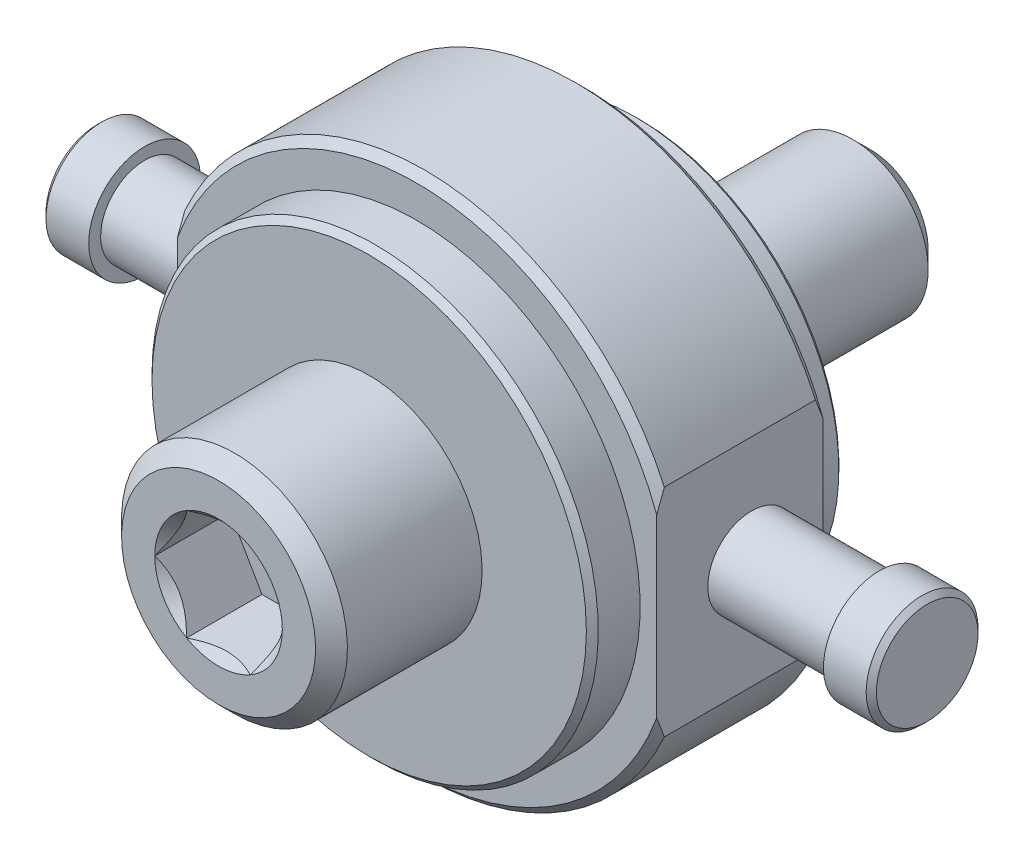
ISO-10303-21;
HEADER;
FILE_DESCRIPTION(('STEP AP214'),'2;1');
FILE_NAME('part.step','',(''),(''),'','','');
FILE_SCHEMA(('AUTOMOTIVE_DESIGN { 1 0 10303 214 1 1 1 1 }'));
ENDSEC;
DATA;
#1=APPLICATION_CONTEXT('core data for automotive mechanical design processes');
#2=APPLICATION_PROTOCOL_DEFINITION('international standard','automotive_design',2000,#1);
#3=PRODUCT_CONTEXT('',#1,'mechanical');
#4=PRODUCT('Part','Part','',(#3));
#5=PRODUCT_RELATED_PRODUCT_CATEGORY('part','',(#4));
#6=PRODUCT_DEFINITION_FORMATION('','',#4);
#7=PRODUCT_DEFINITION_CONTEXT('part definition',#1,'design');
#8=PRODUCT_DEFINITION('design','',#6,#7);
#9=PRODUCT_DEFINITION_SHAPE('','',#8);
#10=(LENGTH_UNIT() NAMED_UNIT(*) SI_UNIT(.MILLI.,.METRE.));
#11=(NAMED_UNIT(*) PLANE_ANGLE_UNIT() SI_UNIT($,.RADIAN.));
#12=(NAMED_UNIT(*) SI_UNIT($,.STERADIAN.) SOLID_ANGLE_UNIT());
#13=UNCERTAINTY_MEASURE_WITH_UNIT(LENGTH_MEASURE(1.E-05),#10,'distance_accuracy_value','');
#14=(GEOMETRIC_REPRESENTATION_CONTEXT(3) GLOBAL_UNCERTAINTY_ASSIGNED_CONTEXT((#13)) GLOBAL_UNIT_ASSIGNED_CONTEXT((#10,
#11,#12)) REPRESENTATION_CONTEXT('',''));
#15=CARTESIAN_POINT('',(0.,0.,0.));
#16=DIRECTION('',(0.,0.,1.));
#17=DIRECTION('',(1.,0.,0.));
#18=AXIS2_PLACEMENT_3D('',#15,#16,#17);
#19=CARTESIAN_POINT('',(-73.1774,11.2715548,14.1284452));
#20=DIRECTION('',(-1.,0.,0.));
#21=DIRECTION('',(0.,-1.,0.));
#22=AXIS2_PLACEMENT_3D('',#19,#20,#21);
#23=PLANE('',#22);
#24=CARTESIAN_POINT('',(-73.1774,0.,25.4));
#25=DIRECTION('',(1.,0.,0.));
#26=DIRECTION('',(0.,1.,0.));
#27=AXIS2_PLACEMENT_3D('',#24,#25,#26);
#28=CIRCLE('',#27,11.1379);
#29=CARTESIAN_POINT('',(-73.1774,11.1379,25.4));
#30=VERTEX_POINT('',#29);
#31=EDGE_CURVE('E326',#30,#30,#28,.F.);
#32=ORIENTED_EDGE('',*,*,#31,.F.);
#33=EDGE_LOOP('',(#32));
#34=FACE_BOUND('',#33,.T.);
#35=CARTESIAN_POINT('',(-73.1774,0.,25.4));
#36=DIRECTION('',(1.,0.,0.));
#37=DIRECTION('',(0.,1.,0.));
#38=AXIS2_PLACEMENT_3D('',#35,#36,#37);
#39=CIRCLE('',#38,8.75665);
#40=CARTESIAN_POINT('',(-73.1774,8.75665,25.4));
#41=VERTEX_POINT('',#40);
#42=EDGE_CURVE('E147',#41,#41,#39,.F.);
#43=ORIENTED_EDGE('',*,*,#42,.T.);
#44=EDGE_LOOP('',(#43));
#45=FACE_BOUND('',#44,.T.);
#46=ADVANCED_FACE('F14',(#34,#45),#23,.F.);
#47=CARTESIAN_POINT('',(73.1774,-11.2715548,14.1284452));
#48=DIRECTION('',(1.,0.,0.));
#49=DIRECTION('',(0.,1.,0.));
#50=AXIS2_PLACEMENT_3D('',#47,#48,#49);
#51=PLANE('',#50);
#52=CARTESIAN_POINT('',(73.1774,0.,25.4));
#53=DIRECTION('',(1.,0.,0.));
#54=DIRECTION('',(0.,1.,0.));
#55=AXIS2_PLACEMENT_3D('',#52,#53,#54);
#56=CIRCLE('',#55,11.1379);
#57=CARTESIAN_POINT('',(73.1774,11.1379,25.4));
#58=VERTEX_POINT('',#57);
#59=EDGE_CURVE('E23',#58,#58,#56,.T.);
#60=ORIENTED_EDGE('',*,*,#59,.F.);
#61=EDGE_LOOP('',(#60));
#62=FACE_BOUND('',#61,.T.);
#63=CARTESIAN_POINT('',(73.1774,0.,25.4));
#64=DIRECTION('',(1.,0.,0.));
#65=DIRECTION('',(0.,0.,-1.));
#66=AXIS2_PLACEMENT_3D('',#63,#64,#65);
#67=CIRCLE('',#66,8.75665);
#68=CARTESIAN_POINT('',(73.1774,0.,16.64335));
#69=VERTEX_POINT('',#68);
#70=EDGE_CURVE('E150',#69,#69,#67,.T.);
#71=ORIENTED_EDGE('',*,*,#70,.T.);
#72=EDGE_LOOP('',(#71));
#73=FACE_BOUND('',#72,.T.);
#74=ADVANCED_FACE('F305',(#62,#73),#51,.F.);
#75=CARTESIAN_POINT('',(12.7017059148,-10.9999999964,68.8479999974));
#76=DIRECTION('',(0.,0.,1.));
#77=DIRECTION('',(0.,1.,0.));
#78=AXIS2_PLACEMENT_3D('',#75,#76,#77);
#79=PLANE('',#78);
#80=DIRECTION('',(-1.,0.,0.));
#81=VECTOR('',#80,1.);
#82=CARTESIAN_POINT('',(0.,10.9999999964,68.8479999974));
#83=LINE('',#82,#81);
#84=CARTESIAN_POINT('',(6.3508529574,10.9999999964,68.8479999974));
#85=VERTEX_POINT('',#84);
#86=CARTESIAN_POINT('',(-6.3508529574,10.9999999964,68.8479999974));
#87=VERTEX_POINT('',#86);
#88=EDGE_CURVE('E161',#85,#87,#83,.T.);
#89=ORIENTED_EDGE('',*,*,#88,.T.);
#90=DIRECTION('',(-0.499999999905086,-0.866025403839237,0.));
#91=VECTOR('',#90,1.);
#92=CARTESIAN_POINT('',(-9.5262794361,5.4999999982,68.8479999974));
#93=LINE('',#92,#91);
#94=CARTESIAN_POINT('',(-12.7017059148,0.,68.8479999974));
#95=VERTEX_POINT('',#94);
#96=EDGE_CURVE('E114',#87,#95,#93,.T.);
#97=ORIENTED_EDGE('',*,*,#96,.T.);
#98=DIRECTION('',(0.499999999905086,-0.866025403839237,0.));
#99=VECTOR('',#98,1.);
#100=CARTESIAN_POINT('',(-9.5262794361,-5.4999999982,68.8479999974));
#101=LINE('',#100,#99);
#102=CARTESIAN_POINT('',(-6.3508529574,-10.9999999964,68.8479999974));
#103=VERTEX_POINT('',#102);
#104=EDGE_CURVE('E451',#95,#103,#101,.T.);
#105=ORIENTED_EDGE('',*,*,#104,.T.);
#106=DIRECTION('',(1.,0.,0.));
#107=VECTOR('',#106,1.);
#108=CARTESIAN_POINT('',(0.,-10.9999999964,68.8479999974));
#109=LINE('',#108,#107);
#110=CARTESIAN_POINT('',(6.3508529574,-10.9999999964,68.8479999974));
#111=VERTEX_POINT('',#110);
#112=EDGE_CURVE('E454',#103,#111,#109,.T.);
#113=ORIENTED_EDGE('',*,*,#112,.T.);
#114=DIRECTION('',(0.499999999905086,0.866025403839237,0.));
#115=VECTOR('',#114,1.);
#116=CARTESIAN_POINT('',(9.5262794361,-5.4999999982,68.8479999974));
#117=LINE('',#116,#115);
#118=CARTESIAN_POINT('',(12.7017059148,0.,68.8479999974));
#119=VERTEX_POINT('',#118);
#120=EDGE_CURVE('E466',#111,#119,#117,.T.);
#121=ORIENTED_EDGE('',*,*,#120,.T.);
#122=DIRECTION('',(-0.499999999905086,0.866025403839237,0.));
#123=VECTOR('',#122,1.);
#124=CARTESIAN_POINT('',(9.5262794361,5.4999999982,68.8479999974));
#125=LINE('',#124,#123);
#126=EDGE_CURVE('E471',#119,#85,#125,.T.);
#127=ORIENTED_EDGE('',*,*,#126,.T.);
#128=EDGE_LOOP('',(#89,#97,#105,#113,#121,#127));
#129=FACE_BOUND('',#128,.T.);
#130=ADVANCED_FACE('F301',(#129),#79,.T.);
#131=CARTESIAN_POINT('',(-6.3508529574,-10.9999999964,68.8479999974));
#132=DIRECTION('',(0.,-1.,0.));
#133=DIRECTION('',(1.,0.,0.));
#134=AXIS2_PLACEMENT_3D('',#131,#132,#133);
#135=PLANE('',#134);
#136=DIRECTION('',(0.,0.,1.));
#137=VECTOR('',#136,1.);
#138=CARTESIAN_POINT('',(6.3508529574,-10.9999999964,76.392999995));
#139=LINE('',#138,#137);
#140=CARTESIAN_POINT('',(6.35085295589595,-10.9999999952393,83.8479999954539));
#141=VERTEX_POINT('',#140);
#142=EDGE_CURVE('E534',#111,#141,#139,.T.);
#143=ORIENTED_EDGE('',*,*,#142,.F.);
#144=ORIENTED_EDGE('',*,*,#112,.F.);
#145=DIRECTION('',(0.,0.,1.));
#146=VECTOR('',#145,1.);
#147=CARTESIAN_POINT('',(-6.3508529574,-10.9999999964,76.392999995));
#148=LINE('',#147,#146);
#149=CARTESIAN_POINT('',(-6.35085295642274,-10.9999999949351,83.8479999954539));
#150=VERTEX_POINT('',#149);
#151=EDGE_CURVE('E476',#103,#150,#148,.T.);
#152=ORIENTED_EDGE('',*,*,#151,.T.);
#153=CARTESIAN_POINT('',(6.35085295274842,-10.9999999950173,83.8479999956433));
#154=CARTESIAN_POINT('',(6.13248914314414,-10.9999999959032,83.7388369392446));
#155=CARTESIAN_POINT('',(5.91241523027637,-10.9999999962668,83.633005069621));
#156=CARTESIAN_POINT('',(5.46858104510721,-10.9999999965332,83.4290618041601));
#157=CARTESIAN_POINT('',(5.24481883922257,-10.9999999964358,83.3309546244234));
#158=CARTESIAN_POINT('',(4.79228664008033,-10.999999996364,83.1431034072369));
#159=CARTESIAN_POINT('',(4.56349531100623,-10.9999999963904,83.0534104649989));
#160=CARTESIAN_POINT('',(4.10215502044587,-10.9999999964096,82.8843356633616));
#161=CARTESIAN_POINT('',(3.86960663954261,-10.9999999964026,82.8049522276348));
#162=CARTESIAN_POINT('',(3.40449093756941,-10.9999999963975,82.659007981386));
#163=CARTESIAN_POINT('',(3.17198076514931,-10.9999999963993,82.5922660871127));
#164=CARTESIAN_POINT('',(2.70370125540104,-10.9999999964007,82.4714362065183));
#165=CARTESIAN_POINT('',(2.46793227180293,-10.9999999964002,82.4173468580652));
#166=CARTESIAN_POINT('',(1.99414352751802,-10.9999999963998,82.3231837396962));
#167=CARTESIAN_POINT('',(1.75613009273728,-10.9999999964,82.2830784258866));
#168=CARTESIAN_POINT('',(1.27810519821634,-10.9999999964,82.2177645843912));
#169=CARTESIAN_POINT('',(1.03809404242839,-10.9999999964,82.192553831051));
#170=CARTESIAN_POINT('',(0.453194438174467,-10.9999999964,82.1502818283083));
#171=CARTESIAN_POINT('',(0.107673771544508,-10.9999999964,82.14141184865));
#172=CARTESIAN_POINT('',(-0.58274252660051,-10.9999999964,82.1563050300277));
#173=CARTESIAN_POINT('',(-0.927637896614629,-10.9999999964,82.1800796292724));
#174=CARTESIAN_POINT('',(-1.61417732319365,-10.9999999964,82.2588586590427));
#175=CARTESIAN_POINT('',(-1.95581730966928,-10.9999999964,82.3138980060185));
#176=CARTESIAN_POINT('',(-2.63322509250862,-10.9999999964,82.4522147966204));
#177=CARTESIAN_POINT('',(-2.96899333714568,-10.9999999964,82.535490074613));
#178=CARTESIAN_POINT('',(-3.56500132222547,-10.9999999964,82.7068004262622));
#179=CARTESIAN_POINT('',(-3.82656159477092,-10.9999999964,82.7903275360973));
#180=CARTESIAN_POINT('',(-4.34498754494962,-10.9999999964,82.9708399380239));
#181=CARTESIAN_POINT('',(-4.60185308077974,-10.9999999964,83.0678256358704));
#182=CARTESIAN_POINT('',(-5.11008045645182,-10.9999999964,83.2730816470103));
#183=CARTESIAN_POINT('',(-5.36145674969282,-10.9999999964,83.3813164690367));
#184=CARTESIAN_POINT('',(-5.85955530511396,-10.9999999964,83.6076501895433));
#185=CARTESIAN_POINT('',(-6.10628030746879,-10.9999999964,83.7257430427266));
#186=CARTESIAN_POINT('',(-6.35085295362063,-10.9999999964,83.8479999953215));
#187=B_SPLINE_CURVE_WITH_KNOTS('',3,(#153,#154,#155,#156,#157,#158,#159,#160,#161,#162,#163,
#164,#165,#166,#167,#168,#169,#170,#171,#172,#173,#174,#175,#176,#177,#178,#179,#180,#181,#182,
#183,#184,#185,#186),.UNSPECIFIED.,.F.,.F.,(4,2,2,2,2,2,2,2,2,2,2,2,2,2,2,2,4),(0.,
0.732420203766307,1.4652374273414,2.2022500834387,2.93914991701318,3.66452778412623,
4.38982752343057,5.11348045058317,5.83702521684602,6.87231264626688,7.90796291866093,
8.94477208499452,9.98150174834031,10.8048356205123,11.6281943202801,12.4490299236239,
13.2693658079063),.UNSPECIFIED.);
#188=EDGE_CURVE('E349',#141,#150,#187,.T.);
#189=ORIENTED_EDGE('',*,*,#188,.F.);
#190=EDGE_LOOP('',(#143,#144,#152,#189));
#191=FACE_BOUND('',#190,.T.);
#192=ADVANCED_FACE('F304',(#191),#135,.F.);
#193=CARTESIAN_POINT('',(6.3508529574,-10.9999999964,68.8479999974));
#194=DIRECTION('',(0.866025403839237,-0.499999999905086,0.));
#195=DIRECTION('',(0.499999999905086,0.866025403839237,0.));
#196=AXIS2_PLACEMENT_3D('',#193,#194,#195);
#197=PLANE('',#196);
#198=DIRECTION('',(0.,0.,1.));
#199=VECTOR('',#198,1.);
#200=CARTESIAN_POINT('',(12.7017059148,0.,76.392999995));
#201=LINE('',#200,#199);
#202=CARTESIAN_POINT('',(12.7017059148,-2.44310833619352E-09,83.8479999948));
#203=VERTEX_POINT('',#202);
#204=EDGE_CURVE('E115',#119,#203,#201,.T.);
#205=ORIENTED_EDGE('',*,*,#204,.F.);
#206=ORIENTED_EDGE('',*,*,#120,.F.);
#207=ORIENTED_EDGE('',*,*,#142,.T.);
#208=CARTESIAN_POINT('',(12.701705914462,-5.85502143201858E-10,83.847999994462));
#209=CARTESIAN_POINT('',(12.5925240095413,-0.189108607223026,83.7388369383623));
#210=CARTESIAN_POINT('',(12.4824870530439,-0.379698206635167,83.633005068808));
#211=CARTESIAN_POINT('',(12.2605699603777,-0.764069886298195,83.4290618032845));
#212=CARTESIAN_POINT('',(12.1486888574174,-0.957853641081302,83.3309546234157));
#213=CARTESIAN_POINT('',(11.9224227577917,-1.34975802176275,83.1431034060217));
#214=CARTESIAN_POINT('',(11.8080270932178,-1.54789712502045,83.0534104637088));
#215=CARTESIAN_POINT('',(11.5773569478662,-1.94742953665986,82.8843356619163));
#216=CARTESIAN_POINT('',(11.4610827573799,-2.14882234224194,82.804952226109));
#217=CARTESIAN_POINT('',(11.2285249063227,-2.5516243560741,82.6590079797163));
#218=CARTESIAN_POINT('',(11.1122698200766,-2.75298407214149,82.5922660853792));
#219=CARTESIAN_POINT('',(10.8781300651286,-3.15852602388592,82.4714362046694));
#220=CARTESIAN_POINT('',(10.7602455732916,-3.36270795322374,82.4173468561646));
#221=CARTESIAN_POINT('',(10.5233512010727,-3.77302104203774,82.3231837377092));
#222=CARTESIAN_POINT('',(10.404344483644,-3.97914672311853,82.2830784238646));
#223=CARTESIAN_POINT('',(10.1653320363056,-4.39312842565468,82.217764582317));
#224=CARTESIAN_POINT('',(10.0453264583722,-4.60098418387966,82.1925538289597));
#225=CARTESIAN_POINT('',(9.75287665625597,-5.10752209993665,82.1502818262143));
#226=CARTESIAN_POINT('',(9.58011632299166,-5.4067517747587,82.1414118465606));
#227=CARTESIAN_POINT('',(9.23490817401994,-6.00466982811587,82.1563050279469));
#228=CARTESIAN_POINT('',(9.06246048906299,-6.30335798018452,82.1800796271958));
#229=CARTESIAN_POINT('',(8.71919077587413,-6.89791856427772,82.2588586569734));
#230=CARTESIAN_POINT('',(8.54837078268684,-7.19378747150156,82.3138980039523));
#231=CARTESIAN_POINT('',(8.20966689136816,-7.78043982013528,82.4522147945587));
#232=CARTESIAN_POINT('',(8.0417827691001,-8.07122364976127,82.5354900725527));
#233=CARTESIAN_POINT('',(7.74377877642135,-8.58738170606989,82.7068004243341));
#234=CARTESIAN_POINT('',(7.61299863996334,-8.81389954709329,82.7903275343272));
#235=CARTESIAN_POINT('',(7.35378566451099,-9.2628695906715,82.9708399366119));
#236=CARTESIAN_POINT('',(7.22535289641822,-9.48532167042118,83.0678256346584));
#237=CARTESIAN_POINT('',(6.97123920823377,-9.92545948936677,83.2730816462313));
#238=CARTESIAN_POINT('',(6.84555106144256,-10.1431577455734,83.3813164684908));
#239=CARTESIAN_POINT('',(6.59650178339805,-10.574523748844,83.6076501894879));
#240=CARTESIAN_POINT('',(6.47313928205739,-10.7881938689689,83.7257430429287));
#241=CARTESIAN_POINT('',(6.35085295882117,-10.9999999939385,83.84799999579));
#242=B_SPLINE_CURVE_WITH_KNOTS('',3,(#208,#209,#210,#211,#212,#213,#214,#215,#216,#217,#218,
#219,#220,#221,#222,#223,#224,#225,#226,#227,#228,#229,#230,#231,#232,#233,#234,#235,#236,#237,
#238,#239,#240,#241),.UNSPECIFIED.,.F.,.F.,(4,2,2,2,2,2,2,2,2,2,2,2,2,2,2,2,4),(0.,
0.732420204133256,1.46523742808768,2.20225008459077,2.93914991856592,3.66452778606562,
4.38982752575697,5.11348045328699,5.83702521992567,6.87231264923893,7.90796292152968,
8.94477208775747,9.98150175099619,10.8048356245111,11.6281943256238,12.4490299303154,
13.2693658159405),.UNSPECIFIED.);
#243=EDGE_CURVE('E343',#203,#141,#242,.T.);
#244=ORIENTED_EDGE('',*,*,#243,.F.);
#245=EDGE_LOOP('',(#205,#206,#207,#244));
#246=FACE_BOUND('',#245,.T.);
#247=ADVANCED_FACE('F355',(#246),#197,.F.);
#248=CARTESIAN_POINT('',(12.7017059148,0.,68.8479999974));
#249=DIRECTION('',(0.866025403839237,0.499999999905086,0.));
#250=DIRECTION('',(-0.499999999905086,0.866025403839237,0.));
#251=AXIS2_PLACEMENT_3D('',#248,#249,#250);
#252=PLANE('',#251);
#253=DIRECTION('',(0.,0.,1.));
#254=VECTOR('',#253,1.);
#255=CARTESIAN_POINT('',(6.3508529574,10.9999999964,76.392999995));
#256=LINE('',#255,#254);
#257=CARTESIAN_POINT('',(6.35085295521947,10.9999999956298,83.8479999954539));
#258=VERTEX_POINT('',#257);
#259=EDGE_CURVE('E82',#85,#258,#256,.T.);
#260=ORIENTED_EDGE('',*,*,#259,.F.);
#261=ORIENTED_EDGE('',*,*,#126,.F.);
#262=ORIENTED_EDGE('',*,*,#204,.T.);
#263=CARTESIAN_POINT('',(6.35085295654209,10.999999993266,83.8479999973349));
#264=CARTESIAN_POINT('',(6.46003486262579,10.810891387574,83.7388369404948));
#265=CARTESIAN_POINT('',(6.57007181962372,10.62030178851,83.6330050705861));
#266=CARTESIAN_POINT('',(6.79198891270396,10.2359301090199,83.429061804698));
#267=CARTESIAN_POINT('',(6.90387001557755,10.0421463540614,83.3309546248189));
#268=CARTESIAN_POINT('',(7.13013611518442,9.65024197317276,83.1431034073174));
#269=CARTESIAN_POINT('',(7.24453177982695,9.45210286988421,83.0534104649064));
#270=CARTESIAN_POINT('',(7.47520192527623,9.05257045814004,82.8843356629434));
#271=CARTESIAN_POINT('',(7.5914761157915,8.85117765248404,82.8049522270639));
#272=CARTESIAN_POINT('',(7.82403396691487,8.44837563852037,82.6590079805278));
#273=CARTESIAN_POINT('',(7.9402890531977,8.24701592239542,82.5922660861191));
#274=CARTESIAN_POINT('',(8.17442880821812,7.84147397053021,82.4714362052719));
#275=CARTESIAN_POINT('',(8.29231330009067,7.63729204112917,82.4173468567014));
#276=CARTESIAN_POINT('',(8.52920767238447,7.22697895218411,82.3231837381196));
#277=CARTESIAN_POINT('',(8.64821438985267,7.02085327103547,82.2830784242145));
#278=CARTESIAN_POINT('',(8.88722683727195,6.60687156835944,82.2177645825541));
#279=CARTESIAN_POINT('',(9.00723241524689,6.39901581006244,82.1925538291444));
#280=CARTESIAN_POINT('',(9.29968221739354,5.89247789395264,82.1502818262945));
#281=CARTESIAN_POINT('',(9.47244255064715,5.59324821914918,82.1414118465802));
#282=CARTESIAN_POINT('',(9.81765069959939,4.99533016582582,82.1563050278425));
#283=CARTESIAN_POINT('',(9.99009838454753,4.69664201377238,82.1800796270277));
#284=CARTESIAN_POINT('',(10.3333680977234,4.10208142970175,82.258858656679));
#285=CARTESIAN_POINT('',(10.5041880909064,3.80621252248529,82.3138980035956));
#286=CARTESIAN_POINT('',(10.842891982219,3.21956017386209,82.4522147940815));
#287=CARTESIAN_POINT('',(11.0107761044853,2.92877634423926,82.5354900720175));
#288=CARTESIAN_POINT('',(11.3087800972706,2.41261828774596,82.7068004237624));
#289=CARTESIAN_POINT('',(11.439560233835,2.18610044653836,82.7903275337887));
#290=CARTESIAN_POINT('',(11.6987732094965,1.7371304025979,82.970839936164));
#291=CARTESIAN_POINT('',(11.827205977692,1.51467832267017,83.067825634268));
#292=CARTESIAN_POINT('',(12.0813196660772,1.07454050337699,83.2730816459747));
#293=CARTESIAN_POINT('',(12.2070078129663,0.856842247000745,83.3813164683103));
#294=CARTESIAN_POINT('',(12.4560570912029,0.425476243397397,83.6076501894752));
#295=CARTESIAN_POINT('',(12.5794195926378,0.211806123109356,83.7257430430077));
#296=CARTESIAN_POINT('',(12.7017059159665,-2.0204794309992E-09,83.8479999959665));
#297=B_SPLINE_CURVE_WITH_KNOTS('',3,(#263,#264,#265,#266,#267,#268,#269,#270,#271,#272,#273,
#274,#275,#276,#277,#278,#279,#280,#281,#282,#283,#284,#285,#286,#287,#288,#289,#290,#291,#292,
#293,#294,#295,#296),.UNSPECIFIED.,.F.,.F.,(4,2,2,2,2,2,2,2,2,2,2,2,2,2,2,2,4),(0.,
0.732420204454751,1.46523742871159,2.2022500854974,2.93914991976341,3.66452778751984,
4.38982752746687,5.11348045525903,5.83702522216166,6.87231265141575,7.90796292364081,
8.94477208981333,9.98150175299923,10.804835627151,11.6281943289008,12.4490299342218,
13.2693658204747),.UNSPECIFIED.);
#298=EDGE_CURVE('E96',#258,#203,#297,.T.);
#299=ORIENTED_EDGE('',*,*,#298,.F.);
#300=EDGE_LOOP('',(#260,#261,#262,#299));
#301=FACE_BOUND('',#300,.T.);
#302=ADVANCED_FACE('F310',(#301),#252,.F.);
#303=CARTESIAN_POINT('',(6.3508529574,10.9999999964,68.8479999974));
#304=DIRECTION('',(0.,1.,0.));
#305=DIRECTION('',(-1.,0.,0.));
#306=AXIS2_PLACEMENT_3D('',#303,#304,#305);
#307=PLANE('',#306);
#308=CARTESIAN_POINT('',(-6.35085295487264,10.999999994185,83.8479999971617));
#309=CARTESIAN_POINT('',(-6.13391532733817,10.9999999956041,83.7395495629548));
#310=CARTESIAN_POINT('',(-5.915290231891,10.9999999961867,83.6343875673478));
#311=CARTESIAN_POINT('',(-5.47440229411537,10.9999999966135,83.4316762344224));
#312=CARTESIAN_POINT('',(-5.25213754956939,10.9999999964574,83.3341310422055));
#313=CARTESIAN_POINT('',(-4.80252623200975,10.9999999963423,83.1472202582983));
#314=CARTESIAN_POINT('',(-4.57515642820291,10.9999999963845,83.0579102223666));
#315=CARTESIAN_POINT('',(-4.11670538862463,10.9999999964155,82.8894546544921));
#316=CARTESIAN_POINT('',(-3.88562475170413,10.9999999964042,82.8103075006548));
#317=CARTESIAN_POINT('',(-3.42055614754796,10.9999999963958,82.6637447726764));
#318=CARTESIAN_POINT('',(-3.18657971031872,10.9999999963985,82.596292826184));
#319=CARTESIAN_POINT('',(-2.71531617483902,10.9999999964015,82.4741875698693));
#320=CARTESIAN_POINT('',(-2.47802946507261,10.9999999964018,82.4195327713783));
#321=CARTESIAN_POINT('',(-2.00129255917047,10.9999999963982,82.3244322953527));
#322=CARTESIAN_POINT('',(-1.7618501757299,10.9999999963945,82.2839476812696));
#323=CARTESIAN_POINT('',(-1.28094613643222,10.9999999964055,82.218066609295));
#324=CARTESIAN_POINT('',(-1.03948517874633,10.9999999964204,82.1926651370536));
#325=CARTESIAN_POINT('',(-0.664754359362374,10.9999999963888,82.1655658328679));
#326=CARTESIAN_POINT('',(-0.531865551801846,10.9999999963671,82.1583439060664));
#327=CARTESIAN_POINT('',(-0.265990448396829,10.9999999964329,82.148707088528));
#328=CARTESIAN_POINT('',(-0.1330042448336,10.9999999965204,82.1462895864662));
#329=CARTESIAN_POINT('',(0.333814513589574,10.9999999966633,82.1463053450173));
#330=CARTESIAN_POINT('',(0.667742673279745,10.9999999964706,82.1615730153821));
#331=CARTESIAN_POINT('',(1.33304026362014,10.9999999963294,82.2218080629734));
#332=CARTESIAN_POINT('',(1.66440774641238,10.9999999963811,82.2667961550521));
#333=CARTESIAN_POINT('',(2.32376806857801,10.999999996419,82.3843595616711));
#334=CARTESIAN_POINT('',(2.65173755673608,10.999999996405,82.4570642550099));
#335=CARTESIAN_POINT('',(3.30133969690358,10.999999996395,82.6267311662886));
#336=CARTESIAN_POINT('',(3.62297105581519,10.9999999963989,82.7236982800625));
#337=CARTESIAN_POINT('',(4.14874119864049,10.9999999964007,82.9010294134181));
#338=CARTESIAN_POINT('',(4.35491421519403,10.9999999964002,82.9754749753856));
#339=CARTESIAN_POINT('',(4.76423320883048,10.9999999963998,83.1322102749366));
#340=CARTESIAN_POINT('',(4.96737949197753,10.9999999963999,83.2144992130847));
#341=CARTESIAN_POINT('',(5.36886857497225,10.9999999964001,83.3852488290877));
#342=CARTESIAN_POINT('',(5.56723824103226,10.9999999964,83.4736466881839));
#343=CARTESIAN_POINT('',(5.96113821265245,10.9999999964,83.6564828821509));
#344=CARTESIAN_POINT('',(6.15666898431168,10.9999999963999,83.7509202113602));
#345=CARTESIAN_POINT('',(6.35085295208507,10.9999999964,83.8479999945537));
#346=B_SPLINE_CURVE_WITH_KNOTS('',3,(#308,#309,#310,#311,#312,#313,#314,#315,#316,#317,#318,
#319,#320,#321,#322,#323,#324,#325,#326,#327,#328,#329,#330,#331,#332,#333,#334,#335,#336,#337,
#338,#339,#340,#341,#342,#343,#344,#345),.UNSPECIFIED.,.F.,.F.,(4,2,2,2,2,2,2,2,2,2,2,2,2,2,2,2,
2,2,4),(0.,0.727636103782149,1.45566547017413,2.18829323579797,2.92080393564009,
3.65099397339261,4.38109902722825,5.10918186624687,5.83702252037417,6.23619691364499,
6.63515428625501,7.63645887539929,8.63846210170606,9.64520103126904,10.6521432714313,
11.3095967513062,11.9669832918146,12.618401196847,13.2697109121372),.UNSPECIFIED.);
#347=CARTESIAN_POINT('',(-6.35085295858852,10.9999999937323,83.8479999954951));
#348=VERTEX_POINT('',#347);
#349=EDGE_CURVE('E86',#348,#258,#346,.T.);
#350=ORIENTED_EDGE('',*,*,#349,.F.);
#351=DIRECTION('',(0.,0.,-1.));
#352=VECTOR('',#351,1.);
#353=CARTESIAN_POINT('',(-6.3508529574,10.9999999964,76.392999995));
#354=LINE('',#353,#352);
#355=EDGE_CURVE('E91',#348,#87,#354,.T.);
#356=ORIENTED_EDGE('',*,*,#355,.T.);
#357=ORIENTED_EDGE('',*,*,#88,.F.);
#358=ORIENTED_EDGE('',*,*,#259,.T.);
#359=EDGE_LOOP('',(#350,#356,#357,#358));
#360=FACE_BOUND('',#359,.T.);
#361=ADVANCED_FACE('F88',(#360),#307,.F.);
#362=CARTESIAN_POINT('',(-6.3508529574,10.9999999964,68.8479999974));
#363=DIRECTION('',(-0.866025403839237,0.499999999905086,0.));
#364=DIRECTION('',(-0.499999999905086,-0.866025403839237,0.));
#365=AXIS2_PLACEMENT_3D('',#362,#363,#364);
#366=PLANE('',#365);
#367=DIRECTION('',(0.,0.,1.));
#368=VECTOR('',#367,1.);
#369=CARTESIAN_POINT('',(-12.7017059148,0.,76.392999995));
#370=LINE('',#369,#368);
#371=CARTESIAN_POINT('',(-12.7017059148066,-1.29119043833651E-09,83.8479999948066));
#372=VERTEX_POINT('',#371);
#373=EDGE_CURVE('E529',#95,#372,#370,.T.);
#374=ORIENTED_EDGE('',*,*,#373,.F.);
#375=ORIENTED_EDGE('',*,*,#96,.F.);
#376=ORIENTED_EDGE('',*,*,#355,.F.);
#377=CARTESIAN_POINT('',(-12.7017059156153,-1.41219822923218E-09,83.8479999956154));
#378=CARTESIAN_POINT('',(-12.5925240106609,0.189108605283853,83.7388369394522));
#379=CARTESIAN_POINT('',(-12.4824870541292,0.379698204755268,83.6330050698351));
#380=CARTESIAN_POINT('',(-12.2605699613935,0.764069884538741,83.4290618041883));
#381=CARTESIAN_POINT('',(-12.1486888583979,0.957853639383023,83.3309546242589));
#382=CARTESIAN_POINT('',(-11.9224227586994,1.34975802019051,83.143103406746));
#383=CARTESIAN_POINT('',(-11.8080270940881,1.54789712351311,83.0534104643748));
#384=CARTESIAN_POINT('',(-11.5773569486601,1.9474295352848,82.8843356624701));
#385=CARTESIAN_POINT('',(-11.4610827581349,2.14882234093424,82.8049522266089));
#386=CARTESIAN_POINT('',(-11.2285249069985,2.55162435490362,82.6590079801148));
#387=CARTESIAN_POINT('',(-11.1122698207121,2.75298407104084,82.59226608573));
#388=CARTESIAN_POINT('',(-10.8781300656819,3.15852602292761,82.4714362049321));
#389=CARTESIAN_POINT('',(-10.760245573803,3.36270795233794,82.4173468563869));
#390=CARTESIAN_POINT('',(-10.5233512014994,3.77302104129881,82.3231837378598));
#391=CARTESIAN_POINT('',(-10.4043444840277,3.97914672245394,82.2830784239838));
#392=CARTESIAN_POINT('',(-10.1653320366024,4.39312842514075,82.2177645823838));
#393=CARTESIAN_POINT('',(-10.0453264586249,4.60098418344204,82.1925538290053));
#394=CARTESIAN_POINT('',(-9.75287665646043,5.10752209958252,82.1502818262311));
#395=CARTESIAN_POINT('',(-9.58011632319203,5.40675177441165,82.1414118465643));
#396=CARTESIAN_POINT('',(-9.2349081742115,6.00466982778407,82.1563050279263));
#397=CARTESIAN_POINT('',(-9.06246048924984,6.30335797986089,82.180079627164));
#398=CARTESIAN_POINT('',(-8.71919077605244,6.89791856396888,82.2588586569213));
#399=CARTESIAN_POINT('',(-8.54837078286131,7.19378747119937,82.3138980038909));
#400=CARTESIAN_POINT('',(-8.20966689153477,7.78043981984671,82.4522147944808));
#401=CARTESIAN_POINT('',(-8.04178276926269,8.07122364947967,82.5354900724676));
#402=CARTESIAN_POINT('',(-7.74377877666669,8.58738170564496,82.7068004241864));
#403=CARTESIAN_POINT('',(-7.61299864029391,8.81389954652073,82.7903275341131));
#404=CARTESIAN_POINT('',(-7.35378566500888,9.26286958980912,82.970839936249));
#405=CARTESIAN_POINT('',(-7.22535289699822,9.4853216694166,83.0678256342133));
#406=CARTESIAN_POINT('',(-6.97123920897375,9.9254594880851,83.2730816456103));
#407=CARTESIAN_POINT('',(-6.84555106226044,10.1431577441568,83.3813164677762));
#408=CARTESIAN_POINT('',(-6.59650178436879,10.5745237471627,83.6076501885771));
#409=CARTESIAN_POINT('',(-6.47313928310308,10.7881938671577,83.7257430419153));
#410=CARTESIAN_POINT('',(-6.35085295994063,10.9999999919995,83.8479999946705));
#411=B_SPLINE_CURVE_WITH_KNOTS('',3,(#377,#378,#379,#380,#381,#382,#383,#384,#385,#386,#387,
#388,#389,#390,#391,#392,#393,#394,#395,#396,#397,#398,#399,#400,#401,#402,#403,#404,#405,#406,
#407,#408,#409,#410),.UNSPECIFIED.,.F.,.F.,(4,2,2,2,2,2,2,2,2,2,2,2,2,2,2,2,4),(0.,
0.732420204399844,1.46523742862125,2.20225008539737,2.93914991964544,3.66452778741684,
4.38982752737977,5.11348045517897,5.83702522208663,6.87231265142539,7.90796292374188,
8.94477208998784,9.98150175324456,10.8048356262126,11.6281943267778,12.4490299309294,
13.2693658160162),.UNSPECIFIED.);
#412=EDGE_CURVE('E95',#372,#348,#411,.T.);
#413=ORIENTED_EDGE('',*,*,#412,.F.);
#414=EDGE_LOOP('',(#374,#375,#376,#413));
#415=FACE_BOUND('',#414,.T.);
#416=ADVANCED_FACE('F111',(#415),#366,.F.);
#417=CARTESIAN_POINT('',(-12.7017059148,0.,68.8479999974));
#418=DIRECTION('',(-0.866025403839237,-0.499999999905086,0.));
#419=DIRECTION('',(0.499999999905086,-0.866025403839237,0.));
#420=AXIS2_PLACEMENT_3D('',#417,#418,#419);
#421=PLANE('',#420);
#422=ORIENTED_EDGE('',*,*,#151,.F.);
#423=ORIENTED_EDGE('',*,*,#104,.F.);
#424=ORIENTED_EDGE('',*,*,#373,.T.);
#425=CARTESIAN_POINT('',(-6.35085295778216,-10.999999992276,83.8479999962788));
#426=CARTESIAN_POINT('',(-6.46003486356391,-10.8108913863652,83.7388369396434));
#427=CARTESIAN_POINT('',(-6.57007182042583,-10.6203017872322,83.6330050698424));
#428=CARTESIAN_POINT('',(-6.79198891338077,-10.2359301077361,83.4290618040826));
#429=CARTESIAN_POINT('',(-6.90387001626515,-10.0421463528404,83.3309546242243));
#430=CARTESIAN_POINT('',(-7.13013611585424,-9.65024197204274,83.1431034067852));
#431=CARTESIAN_POINT('',(-7.24453178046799,-9.45210286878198,83.0534104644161));
#432=CARTESIAN_POINT('',(-7.47520192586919,-9.05257045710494,82.8843356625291));
#433=CARTESIAN_POINT('',(-7.59147611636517,-8.85117765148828,82.8049522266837));
#434=CARTESIAN_POINT('',(-7.8240339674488,-8.4483756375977,82.6590079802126));
#435=CARTESIAN_POINT('',(-7.94028905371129,-8.24701592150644,82.5922660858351));
#436=CARTESIAN_POINT('',(-8.1744288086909,-7.84147396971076,82.4714362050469));
#437=CARTESIAN_POINT('',(-8.29231330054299,-7.63729204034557,82.4173468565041));
#438=CARTESIAN_POINT('',(-8.52920767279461,-7.22697895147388,82.323183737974));
#439=CARTESIAN_POINT('',(-8.64821439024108,-7.02085327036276,82.2830784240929));
#440=CARTESIAN_POINT('',(-8.88722683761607,-6.60687156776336,82.2177645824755));
#441=CARTESIAN_POINT('',(-9.00723241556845,-6.39901580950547,82.192553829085));
#442=CARTESIAN_POINT('',(-9.2996822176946,-5.89247789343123,82.1502818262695));
#443=CARTESIAN_POINT('',(-9.47244255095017,-5.59324821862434,82.1414118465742));
#444=CARTESIAN_POINT('',(-9.81765069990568,-4.99533016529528,82.1563050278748));
#445=CARTESIAN_POINT('',(-9.99009838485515,-4.69664201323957,82.1800796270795));
#446=CARTESIAN_POINT('',(-10.3333680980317,-4.10208142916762,82.2588586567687));
#447=CARTESIAN_POINT('',(-10.5041880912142,-3.80621252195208,82.3138980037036));
#448=CARTESIAN_POINT('',(-10.8428919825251,-3.21956017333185,82.4522147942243));
#449=CARTESIAN_POINT('',(-11.0107761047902,-2.92877634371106,82.5354900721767));
#450=CARTESIAN_POINT('',(-11.3087800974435,-2.4126182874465,82.7068004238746));
#451=CARTESIAN_POINT('',(-11.4395602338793,-2.18610044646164,82.7903275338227));
#452=CARTESIAN_POINT('',(-11.6987732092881,-1.73713040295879,82.9708399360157));
#453=CARTESIAN_POINT('',(-11.8272059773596,-1.51467832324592,83.0678256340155));
#454=CARTESIAN_POINT('',(-12.081319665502,-1.0745405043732,83.2730816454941));
#455=CARTESIAN_POINT('',(-12.2070078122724,-0.856842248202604,83.3813164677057));
#456=CARTESIAN_POINT('',(-12.4560570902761,-0.425476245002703,83.6076501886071));
#457=CARTESIAN_POINT('',(-12.5794195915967,-0.211806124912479,83.7257430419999));
#458=CARTESIAN_POINT('',(-12.7017059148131,2.27834983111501E-11,83.8479999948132));
#459=B_SPLINE_CURVE_WITH_KNOTS('',3,(#425,#426,#427,#428,#429,#430,#431,#432,#433,#434,#435,
#436,#437,#438,#439,#440,#441,#442,#443,#444,#445,#446,#447,#448,#449,#450,#451,#452,#453,#454,
#455,#456,#457,#458),.UNSPECIFIED.,.F.,.F.,(4,2,2,2,2,2,2,2,2,2,2,2,2,2,2,2,4),(0.,
0.732420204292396,1.46523742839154,2.20225008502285,2.93914991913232,3.66452778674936,
4.3898275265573,5.11348045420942,5.83702522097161,6.87231265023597,7.9079629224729,
8.94477208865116,9.98150175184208,10.8048356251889,11.6281943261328,12.449029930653,
13.2693658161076),.UNSPECIFIED.);
#460=EDGE_CURVE('E121',#150,#372,#459,.T.);
#461=ORIENTED_EDGE('',*,*,#460,.F.);
#462=EDGE_LOOP('',(#422,#423,#424,#461));
#463=FACE_BOUND('',#462,.T.);
#464=ADVANCED_FACE('F362',(#463),#421,.F.);
#465=CARTESIAN_POINT('',(0.,0.,82.135225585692));
#466=DIRECTION('',(0.,0.,1.));
#467=DIRECTION('',(0.,1.,0.));
#468=AXIS2_PLACEMENT_3D('',#465,#466,#467);
#469=CONICAL_SURFACE('',#468,10.988931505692,0.785398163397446);
#470=CARTESIAN_POINT('',(0.,0.,83.8479999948));
#471=DIRECTION('',(0.,0.,1.));
#472=DIRECTION('',(0.,1.,0.));
#473=AXIS2_PLACEMENT_3D('',#470,#471,#472);
#474=CIRCLE('',#473,12.7017059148);
#475=EDGE_CURVE('E140',#141,#150,#474,.F.);
#476=ORIENTED_EDGE('',*,*,#475,.F.);
#477=ORIENTED_EDGE('',*,*,#188,.T.);
#478=EDGE_LOOP('',(#476,#477));
#479=FACE_BOUND('',#478,.T.);
#480=ADVANCED_FACE('F340',(#479),#469,.F.);
#481=CARTESIAN_POINT('',(0.,0.,82.135225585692));
#482=DIRECTION('',(0.,0.,1.));
#483=DIRECTION('',(0.,1.,0.));
#484=AXIS2_PLACEMENT_3D('',#481,#482,#483);
#485=CONICAL_SURFACE('',#484,10.988931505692,0.785398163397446);
#486=CARTESIAN_POINT('',(0.,0.,83.8479999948));
#487=DIRECTION('',(0.,0.,1.));
#488=DIRECTION('',(0.,1.,0.));
#489=AXIS2_PLACEMENT_3D('',#486,#487,#488);
#490=CIRCLE('',#489,12.7017059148);
#491=EDGE_CURVE('E143',#203,#141,#490,.F.);
#492=ORIENTED_EDGE('',*,*,#491,.F.);
#493=ORIENTED_EDGE('',*,*,#243,.T.);
#494=EDGE_LOOP('',(#492,#493));
#495=FACE_BOUND('',#494,.T.);
#496=ADVANCED_FACE('F336',(#495),#485,.F.);
#497=CARTESIAN_POINT('',(0.,0.,82.135225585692));
#498=DIRECTION('',(0.,0.,1.));
#499=DIRECTION('',(0.,1.,0.));
#500=AXIS2_PLACEMENT_3D('',#497,#498,#499);
#501=CONICAL_SURFACE('',#500,10.988931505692,0.785398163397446);
#502=CARTESIAN_POINT('',(0.,0.,83.8479999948));
#503=DIRECTION('',(0.,0.,1.));
#504=DIRECTION('',(0.,1.,0.));
#505=AXIS2_PLACEMENT_3D('',#502,#503,#504);
#506=CIRCLE('',#505,12.7017059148);
#507=EDGE_CURVE('E104',#258,#203,#506,.F.);
#508=ORIENTED_EDGE('',*,*,#507,.F.);
#509=ORIENTED_EDGE('',*,*,#298,.T.);
#510=EDGE_LOOP('',(#508,#509));
#511=FACE_BOUND('',#510,.T.);
#512=ADVANCED_FACE('F331',(#511),#501,.F.);
#513=CARTESIAN_POINT('',(0.,0.,82.1360838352));
#514=DIRECTION('',(0.,0.,1.));
#515=DIRECTION('',(0.,1.,0.));
#516=AXIS2_PLACEMENT_3D('',#513,#514,#515);
#517=CONICAL_SURFACE('',#516,10.9897897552,0.785398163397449);
#518=ORIENTED_EDGE('',*,*,#349,.T.);
#519=CARTESIAN_POINT('',(0.,0.,83.8479999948));
#520=DIRECTION('',(0.,0.,1.));
#521=DIRECTION('',(0.,1.,0.));
#522=AXIS2_PLACEMENT_3D('',#519,#520,#521);
#523=CIRCLE('',#522,12.7017059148);
#524=EDGE_CURVE('E99',#348,#258,#523,.F.);
#525=ORIENTED_EDGE('',*,*,#524,.F.);
#526=EDGE_LOOP('',(#518,#525));
#527=FACE_BOUND('',#526,.T.);
#528=ADVANCED_FACE('F100',(#527),#517,.F.);
#529=CARTESIAN_POINT('',(0.,0.,82.135225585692));
#530=DIRECTION('',(0.,0.,1.));
#531=DIRECTION('',(0.,1.,0.));
#532=AXIS2_PLACEMENT_3D('',#529,#530,#531);
#533=CONICAL_SURFACE('',#532,10.988931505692,0.785398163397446);
#534=CARTESIAN_POINT('',(0.,0.,83.8479999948));
#535=DIRECTION('',(0.,0.,1.));
#536=DIRECTION('',(0.,1.,0.));
#537=AXIS2_PLACEMENT_3D('',#534,#535,#536);
#538=CIRCLE('',#537,12.7017059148);
#539=EDGE_CURVE('E105',#372,#348,#538,.F.);
#540=ORIENTED_EDGE('',*,*,#539,.F.);
#541=ORIENTED_EDGE('',*,*,#412,.T.);
#542=EDGE_LOOP('',(#540,#541));
#543=FACE_BOUND('',#542,.T.);
#544=ADVANCED_FACE('F119',(#543),#533,.F.);
#545=CARTESIAN_POINT('',(0.,0.,82.135225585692));
#546=DIRECTION('',(0.,0.,1.));
#547=DIRECTION('',(0.,1.,0.));
#548=AXIS2_PLACEMENT_3D('',#545,#546,#547);
#549=CONICAL_SURFACE('',#548,10.988931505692,0.785398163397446);
#550=CARTESIAN_POINT('',(0.,0.,83.8479999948));
#551=DIRECTION('',(0.,0.,1.));
#552=DIRECTION('',(0.,1.,0.));
#553=AXIS2_PLACEMENT_3D('',#550,#551,#552);
#554=CIRCLE('',#553,12.7017059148);
#555=EDGE_CURVE('E127',#150,#372,#554,.F.);
#556=ORIENTED_EDGE('',*,*,#555,.F.);
#557=ORIENTED_EDGE('',*,*,#460,.T.);
#558=EDGE_LOOP('',(#556,#557));
#559=FACE_BOUND('',#558,.T.);
#560=ADVANCED_FACE('F181',(#559),#549,.F.);
#561=CARTESIAN_POINT('',(19.5569000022,-19.5569000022,83.8479999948));
#562=DIRECTION('',(0.,0.,1.));
#563=DIRECTION('',(0.,1.,0.));
#564=AXIS2_PLACEMENT_3D('',#561,#562,#563);
#565=PLANE('',#564);
#566=ORIENTED_EDGE('',*,*,#555,.T.);
#567=ORIENTED_EDGE('',*,*,#539,.T.);
#568=ORIENTED_EDGE('',*,*,#524,.T.);
#569=ORIENTED_EDGE('',*,*,#507,.T.);
#570=ORIENTED_EDGE('',*,*,#491,.T.);
#571=ORIENTED_EDGE('',*,*,#475,.T.);
#572=EDGE_LOOP('',(#566,#567,#568,#569,#570,#571));
#573=FACE_BOUND('',#572,.T.);
#574=CARTESIAN_POINT('',(0.,0.,83.8479999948));
#575=DIRECTION('',(0.,0.,-1.));
#576=DIRECTION('',(0.,-1.,0.));
#577=AXIS2_PLACEMENT_3D('',#574,#575,#576);
#578=CIRCLE('',#577,19.3250000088);
#579=CARTESIAN_POINT('',(0.,-19.3250000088,83.8479999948));
#580=VERTEX_POINT('',#579);
#581=EDGE_CURVE('E142',#580,#580,#578,.F.);
#582=ORIENTED_EDGE('',*,*,#581,.T.);
#583=EDGE_LOOP('',(#582));
#584=FACE_BOUND('',#583,.T.);
#585=ADVANCED_FACE('F123',(#573,#584),#565,.T.);
#586=CARTESIAN_POINT('',(0.,0.,83.8479999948));
#587=DIRECTION('',(0.,0.,-1.));
#588=DIRECTION('',(0.,-1.,0.));
#589=AXIS2_PLACEMENT_3D('',#586,#587,#588);
#590=CONICAL_SURFACE('',#589,19.3250000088,0.785398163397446);
#591=ORIENTED_EDGE('',*,*,#581,.F.);
#592=EDGE_LOOP('',(#591));
#593=FACE_BOUND('',#592,.T.);
#594=CARTESIAN_POINT('',(0.,0.,80.6729999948));
#595=DIRECTION('',(0.,0.,-1.));
#596=DIRECTION('',(0.,-1.,0.));
#597=AXIS2_PLACEMENT_3D('',#594,#595,#596);
#598=CIRCLE('',#597,22.5000000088);
#599=CARTESIAN_POINT('',(0.,-22.5000000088,80.6729999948));
#600=VERTEX_POINT('',#599);
#601=EDGE_CURVE('E427',#600,#600,#598,.F.);
#602=ORIENTED_EDGE('',*,*,#601,.T.);
#603=EDGE_LOOP('',(#602));
#604=FACE_BOUND('',#603,.T.);
#605=ADVANCED_FACE('F264',(#593,#604),#590,.T.);
#606=CARTESIAN_POINT('',(0.,0.,0.));
#607=DIRECTION('',(0.,0.,-1.));
#608=DIRECTION('',(0.,-1.,0.));
#609=AXIS2_PLACEMENT_3D('',#606,#607,#608);
#610=CYLINDRICAL_SURFACE('',#609,14.9999999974);
#611=CARTESIAN_POINT('',(0.,0.,-42.4999999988));
#612=DIRECTION('',(0.,0.,-1.));
#613=DIRECTION('',(-1.,0.,0.));
#614=AXIS2_PLACEMENT_3D('',#611,#612,#613);
#615=CIRCLE('',#614,14.9999999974);
#616=CARTESIAN_POINT('',(-14.9999999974,0.,-42.4999999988));
#617=VERTEX_POINT('',#616);
#618=EDGE_CURVE('E430',#617,#617,#615,.F.);
#619=ORIENTED_EDGE('',*,*,#618,.T.);
#620=EDGE_LOOP('',(#619));
#621=FACE_BOUND('',#620,.T.);
#622=CARTESIAN_POINT('',(0.,0.,0.));
#623=DIRECTION('',(0.,0.,-1.));
#624=DIRECTION('',(0.,-1.,0.));
#625=AXIS2_PLACEMENT_3D('',#622,#623,#624);
#626=CIRCLE('',#625,14.9999999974);
#627=CARTESIAN_POINT('',(0.,-14.9999999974,0.));
#628=VERTEX_POINT('',#627);
#629=EDGE_CURVE('E632',#628,#628,#626,.F.);
#630=ORIENTED_EDGE('',*,*,#629,.F.);
#631=EDGE_LOOP('',(#630));
#632=FACE_BOUND('',#631,.T.);
#633=ADVANCED_FACE('F268',(#621,#632),#610,.T.);
#634=CARTESIAN_POINT('',(0.,0.,80.6729999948));
#635=DIRECTION('',(0.,0.,-1.));
#636=DIRECTION('',(0.,-1.,0.));
#637=AXIS2_PLACEMENT_3D('',#634,#635,#636);
#638=CYLINDRICAL_SURFACE('',#637,22.5000000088);
#639=ORIENTED_EDGE('',*,*,#601,.F.);
#640=EDGE_LOOP('',(#639));
#641=FACE_BOUND('',#640,.T.);
#642=CARTESIAN_POINT('',(0.,0.,53.848));
#643=DIRECTION('',(0.,0.,-1.));
#644=DIRECTION('',(0.,-1.,0.));
#645=AXIS2_PLACEMENT_3D('',#642,#643,#644);
#646=CIRCLE('',#645,22.5000000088);
#647=CARTESIAN_POINT('',(0.,-22.5000000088,53.848));
#648=VERTEX_POINT('',#647);
#649=EDGE_CURVE('E486',#648,#648,#646,.T.);
#650=ORIENTED_EDGE('',*,*,#649,.F.);
#651=EDGE_LOOP('',(#650));
#652=FACE_BOUND('',#651,.T.);
#653=ADVANCED_FACE('F270',(#641,#652),#638,.T.);
#654=CARTESIAN_POINT('',(40.19716624,40.19716624,0.));
#655=DIRECTION('',(0.,0.,-1.));
#656=DIRECTION('',(0.,-1.,0.));
#657=AXIS2_PLACEMENT_3D('',#654,#655,#656);
#658=PLANE('',#657);
#659=ORIENTED_EDGE('',*,*,#629,.T.);
#660=EDGE_LOOP('',(#659));
#661=FACE_BOUND('',#660,.T.);
#662=CARTESIAN_POINT('',(0.,0.,0.));
#663=DIRECTION('',(0.,0.,1.));
#664=DIRECTION('',(0.,1.,0.));
#665=AXIS2_PLACEMENT_3D('',#662,#663,#664);
#666=CIRCLE('',#665,39.72052);
#667=CARTESIAN_POINT('',(0.,39.72052,0.));
#668=VERTEX_POINT('',#667);
#669=EDGE_CURVE('E489',#668,#668,#666,.F.);
#670=ORIENTED_EDGE('',*,*,#669,.T.);
#671=EDGE_LOOP('',(#670));
#672=FACE_BOUND('',#671,.T.);
#673=ADVANCED_FACE('F273',(#661,#672),#658,.T.);
#674=CARTESIAN_POINT('',(43.7784875,-43.7784875,53.848));
#675=DIRECTION('',(0.,0.,1.));
#676=DIRECTION('',(0.,1.,0.));
#677=AXIS2_PLACEMENT_3D('',#674,#675,#676);
#678=PLANE('',#677);
#679=ORIENTED_EDGE('',*,*,#649,.T.);
#680=EDGE_LOOP('',(#679));
#681=FACE_BOUND('',#680,.T.);
#682=CARTESIAN_POINT('',(0.,0.,53.848));
#683=DIRECTION('',(0.,0.,-1.));
#684=DIRECTION('',(0.,-1.,0.));
#685=AXIS2_PLACEMENT_3D('',#682,#683,#684);
#686=CIRCLE('',#685,43.259375);
#687=CARTESIAN_POINT('',(0.,-43.259375,53.848));
#688=VERTEX_POINT('',#687);
#689=EDGE_CURVE('E450',#688,#688,#686,.F.);
#690=ORIENTED_EDGE('',*,*,#689,.T.);
#691=EDGE_LOOP('',(#690));
#692=FACE_BOUND('',#691,.T.);
#693=ADVANCED_FACE('F299',(#681,#692),#678,.T.);
#694=CARTESIAN_POINT('',(0.,0.,0.));
#695=DIRECTION('',(0.,0.,1.));
#696=DIRECTION('',(0.,1.,0.));
#697=AXIS2_PLACEMENT_3D('',#694,#695,#696);
#698=CONICAL_SURFACE('',#697,39.72052,0.785398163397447);
#699=CARTESIAN_POINT('',(0.,0.,0.79248));
#700=DIRECTION('',(0.,0.,-1.));
#701=DIRECTION('',(0.,-1.,0.));
#702=AXIS2_PLACEMENT_3D('',#699,#700,#701);
#703=CIRCLE('',#702,40.513);
#704=CARTESIAN_POINT('',(0.,-40.513,0.792480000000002));
#705=VERTEX_POINT('',#704);
#706=EDGE_CURVE('E426',#705,#705,#703,.T.);
#707=ORIENTED_EDGE('',*,*,#706,.T.);
#708=EDGE_LOOP('',(#707));
#709=FACE_BOUND('',#708,.T.);
#710=ORIENTED_EDGE('',*,*,#669,.F.);
#711=EDGE_LOOP('',(#710));
#712=FACE_BOUND('',#711,.T.);
#713=ADVANCED_FACE('F283',(#709,#712),#698,.T.);
#714=CARTESIAN_POINT('',(0.,0.,53.848));
#715=DIRECTION('',(0.,0.,-1.));
#716=DIRECTION('',(0.,-1.,0.));
#717=AXIS2_PLACEMENT_3D('',#714,#715,#716);
#718=CONICAL_SURFACE('',#717,43.259375,0.785398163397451);
#719=ORIENTED_EDGE('',*,*,#689,.F.);
#720=EDGE_LOOP('',(#719));
#721=FACE_BOUND('',#720,.T.);
#722=CARTESIAN_POINT('',(0.,0.,52.657375));
#723=DIRECTION('',(0.,0.,-1.));
#724=DIRECTION('',(0.,-1.,0.));
#725=AXIS2_PLACEMENT_3D('',#722,#723,#724);
#726=CIRCLE('',#725,44.45);
#727=CARTESIAN_POINT('',(0.,-44.45,52.657375));
#728=VERTEX_POINT('',#727);
#729=EDGE_CURVE('E423',#728,#728,#726,.T.);
#730=ORIENTED_EDGE('',*,*,#729,.F.);
#731=EDGE_LOOP('',(#730));
#732=FACE_BOUND('',#731,.T.);
#733=ADVANCED_FACE('F280',(#721,#732),#718,.T.);
#734=CARTESIAN_POINT('',(0.,0.,11.176));
#735=DIRECTION('',(0.,0.,-1.));
#736=DIRECTION('',(0.,-1.,0.));
#737=AXIS2_PLACEMENT_3D('',#734,#735,#736);
#738=CYLINDRICAL_SURFACE('',#737,40.513);
#739=ORIENTED_EDGE('',*,*,#706,.F.);
#740=EDGE_LOOP('',(#739));
#741=FACE_BOUND('',#740,.T.);
#742=CARTESIAN_POINT('',(0.,0.,11.176));
#743=DIRECTION('',(0.,0.,-1.));
#744=DIRECTION('',(0.,-1.,0.));
#745=AXIS2_PLACEMENT_3D('',#742,#743,#744);
#746=CIRCLE('',#745,40.513);
#747=CARTESIAN_POINT('',(0.,-40.513,11.176));
#748=VERTEX_POINT('',#747);
#749=EDGE_CURVE('E155',#748,#748,#746,.F.);
#750=ORIENTED_EDGE('',*,*,#749,.F.);
#751=EDGE_LOOP('',(#750));
#752=FACE_BOUND('',#751,.T.);
#753=ADVANCED_FACE('F278',(#741,#752),#738,.T.);
#754=CARTESIAN_POINT('',(0.,0.,52.657375));
#755=DIRECTION('',(0.,0.,-1.));
#756=DIRECTION('',(-1.,0.,0.));
#757=AXIS2_PLACEMENT_3D('',#754,#755,#756);
#758=CYLINDRICAL_SURFACE('',#757,44.45);
#759=CARTESIAN_POINT('',(0.,0.,44.323));
#760=DIRECTION('',(0.,0.,-1.));
#761=DIRECTION('',(-1.,0.,0.));
#762=AXIS2_PLACEMENT_3D('',#759,#760,#761);
#763=CIRCLE('',#762,44.45);
#764=CARTESIAN_POINT('',(-44.45,0.,44.323));
#765=VERTEX_POINT('',#764);
#766=EDGE_CURVE('E442',#765,#765,#763,.T.);
#767=ORIENTED_EDGE('',*,*,#766,.F.);
#768=EDGE_LOOP('',(#767));
#769=FACE_BOUND('',#768,.T.);
#770=ORIENTED_EDGE('',*,*,#729,.T.);
#771=EDGE_LOOP('',(#770));
#772=FACE_BOUND('',#771,.T.);
#773=ADVANCED_FACE('F275',(#769,#772),#758,.T.);
#774=CARTESIAN_POINT('',(0.,0.,11.176));
#775=DIRECTION('',(0.,0.,1.));
#776=DIRECTION('',(0.,1.,0.));
#777=AXIS2_PLACEMENT_3D('',#774,#775,#776);
#778=CONICAL_SURFACE('',#777,50.8635,0.785398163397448);
#779=CARTESIAN_POINT('',(47.7520000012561,-21.5452234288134,12.7000000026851));
#780=CARTESIAN_POINT('',(47.7520000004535,-21.2132064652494,12.5634532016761));
#781=CARTESIAN_POINT('',(47.7520000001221,-20.8802647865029,12.4291472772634));
#782=CARTESIAN_POINT('',(47.7519999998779,-20.2125977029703,12.1652586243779));
#783=CARTESIAN_POINT('',(47.7519999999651,-19.8778726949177,12.0356748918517));
#784=CARTESIAN_POINT('',(47.7520000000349,-19.2065591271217,11.7814121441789));
#785=CARTESIAN_POINT('',(47.7520000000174,-18.8699705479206,11.6567331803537));
#786=CARTESIAN_POINT('',(47.7519999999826,-18.1948665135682,11.4124768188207));
#787=CARTESIAN_POINT('',(47.7519999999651,-17.8563506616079,11.2929005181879));
#788=CARTESIAN_POINT('',(47.752,-17.516909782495,11.1760000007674));
#789=B_SPLINE_CURVE_WITH_KNOTS('',3,(#779,#780,#781,#782,#783,#784,#785,#786,#787,#788),
.UNSPECIFIED.,.F.,.F.,(4,2,2,2,4),(0.,1.07699302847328,2.15375570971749,3.23052965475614,
4.30753395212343),.UNSPECIFIED.);
#790=CARTESIAN_POINT('',(47.752,-21.5452234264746,12.7));
#791=VERTEX_POINT('',#790);
#792=CARTESIAN_POINT('',(47.752,-17.5169097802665,11.176));
#793=VERTEX_POINT('',#792);
#794=EDGE_CURVE('E226',#791,#793,#789,.T.);
#795=ORIENTED_EDGE('',*,*,#794,.F.);
#796=CARTESIAN_POINT('',(0.,0.,12.7));
#797=DIRECTION('',(0.,0.,-1.));
#798=DIRECTION('',(0.,-1.,0.));
#799=AXIS2_PLACEMENT_3D('',#796,#797,#798);
#800=CIRCLE('',#799,52.3875);
#801=CARTESIAN_POINT('',(-47.752,-21.5452234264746,12.7000000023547));
#802=VERTEX_POINT('',#801);
#803=EDGE_CURVE('E158',#791,#802,#800,.T.);
#804=ORIENTED_EDGE('',*,*,#803,.T.);
#805=CARTESIAN_POINT('',(-47.75199999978,-17.5169097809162,11.1760000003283));
#806=CARTESIAN_POINT('',(-47.7519999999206,-17.8563506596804,11.2929005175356));
#807=CARTESIAN_POINT('',(-47.7519999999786,-18.1948665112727,11.412476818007));
#808=CARTESIAN_POINT('',(-47.7520000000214,-18.8699705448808,11.6567331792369));
#809=CARTESIAN_POINT('',(-47.7520000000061,-19.2065591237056,11.7814121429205));
#810=CARTESIAN_POINT('',(-47.7519999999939,-19.877872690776,12.0356748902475));
#811=CARTESIAN_POINT('',(-47.7519999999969,-20.212597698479,12.1652586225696));
#812=CARTESIAN_POINT('',(-47.7520000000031,-20.8802647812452,12.4291472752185));
#813=CARTESIAN_POINT('',(-47.7520000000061,-21.2132064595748,12.5634531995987));
#814=CARTESIAN_POINT('',(-47.752,-21.5452234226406,12.7000000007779));
#815=B_SPLINE_CURVE_WITH_KNOTS('',3,(#805,#806,#807,#808,#809,#810,#811,#812,#813,#814),
.UNSPECIFIED.,.F.,.F.,(4,2,2,2,4),(0.,1.07700429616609,2.15377823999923,3.23054092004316,
4.30753394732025),.UNSPECIFIED.);
#816=CARTESIAN_POINT('',(-47.752,-17.5169097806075,11.1760000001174));
#817=VERTEX_POINT('',#816);
#818=EDGE_CURVE('E402',#817,#802,#815,.T.);
#819=ORIENTED_EDGE('',*,*,#818,.F.);
#820=CARTESIAN_POINT('',(0.,0.,11.176));
#821=DIRECTION('',(0.,0.,1.));
#822=DIRECTION('',(0.,1.,0.));
#823=AXIS2_PLACEMENT_3D('',#820,#821,#822);
#824=CIRCLE('',#823,50.8635);
#825=EDGE_CURVE('E151',#793,#817,#824,.F.);
#826=ORIENTED_EDGE('',*,*,#825,.F.);
#827=EDGE_LOOP('',(#795,#804,#819,#826));
#828=FACE_BOUND('',#827,.T.);
#829=ADVANCED_FACE('F201',(#828),#778,.T.);
#830=CARTESIAN_POINT('',(47.752,51.473862,11.176));
#831=DIRECTION('',(0.,0.,-1.));
#832=DIRECTION('',(0.,-1.,0.));
#833=AXIS2_PLACEMENT_3D('',#830,#831,#832);
#834=PLANE('',#833);
#835=ORIENTED_EDGE('',*,*,#749,.T.);
#836=EDGE_LOOP('',(#835));
#837=FACE_BOUND('',#836,.T.);
#838=DIRECTION('',(0.,-1.,0.));
#839=VECTOR('',#838,1.);
#840=CARTESIAN_POINT('',(-47.752,0.,11.176));
#841=LINE('',#840,#839);
#842=CARTESIAN_POINT('',(-47.752,17.5169097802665,11.176));
#843=VERTEX_POINT('',#842);
#844=EDGE_CURVE('E395',#843,#817,#841,.T.);
#845=ORIENTED_EDGE('',*,*,#844,.F.);
#846=CARTESIAN_POINT('',(0.,0.,11.176));
#847=DIRECTION('',(0.,0.,1.));
#848=DIRECTION('',(0.,1.,0.));
#849=AXIS2_PLACEMENT_3D('',#846,#847,#848);
#850=CIRCLE('',#849,50.8635);
#851=CARTESIAN_POINT('',(47.752,17.5169097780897,11.1759999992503));
#852=VERTEX_POINT('',#851);
#853=EDGE_CURVE('E154',#843,#852,#850,.F.);
#854=ORIENTED_EDGE('',*,*,#853,.T.);
#855=DIRECTION('',(0.,1.,0.));
#856=VECTOR('',#855,1.);
#857=CARTESIAN_POINT('',(47.752,0.,11.176));
#858=LINE('',#857,#856);
#859=EDGE_CURVE('E223',#793,#852,#858,.T.);
#860=ORIENTED_EDGE('',*,*,#859,.F.);
#861=ORIENTED_EDGE('',*,*,#825,.T.);
#862=EDGE_LOOP('',(#845,#854,#860,#861));
#863=FACE_BOUND('',#862,.T.);
#864=ADVANCED_FACE('F199',(#837,#863),#834,.T.);
#865=CARTESIAN_POINT('',(0.,0.,11.176));
#866=DIRECTION('',(0.,0.,1.));
#867=DIRECTION('',(0.,1.,0.));
#868=AXIS2_PLACEMENT_3D('',#865,#866,#867);
#869=CONICAL_SURFACE('',#868,50.8635,0.785398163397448);
#870=ORIENTED_EDGE('',*,*,#853,.F.);
#871=CARTESIAN_POINT('',(-47.7520000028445,21.545223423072,12.6999999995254));
#872=CARTESIAN_POINT('',(-47.7520000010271,21.2132064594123,12.5634531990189));
#873=CARTESIAN_POINT('',(-47.7520000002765,20.8802647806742,12.4291472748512));
#874=CARTESIAN_POINT('',(-47.7519999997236,20.2125976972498,12.1652586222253));
#875=CARTESIAN_POINT('',(-47.751999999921,19.877872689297,12.0356748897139));
#876=CARTESIAN_POINT('',(-47.752000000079,19.2065591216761,11.7814121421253));
#877=CARTESIAN_POINT('',(-47.7520000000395,18.8699705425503,11.6567331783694));
#878=CARTESIAN_POINT('',(-47.7519999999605,18.1948665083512,11.4124768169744));
#879=CARTESIAN_POINT('',(-47.751999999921,17.8563506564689,11.2929005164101));
#880=CARTESIAN_POINT('',(-47.752,17.5169097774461,11.1759999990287));
#881=B_SPLINE_CURVE_WITH_KNOTS('',3,(#871,#872,#873,#874,#875,#876,#877,#878,#879,#880),
.UNSPECIFIED.,.F.,.F.,(4,2,2,2,4),(0.,1.07699302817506,2.15375570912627,3.23052965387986,
4.30753395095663),.UNSPECIFIED.);
#882=CARTESIAN_POINT('',(-47.752,21.5452234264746,12.7));
#883=VERTEX_POINT('',#882);
#884=EDGE_CURVE('E206',#883,#843,#881,.T.);
#885=ORIENTED_EDGE('',*,*,#884,.F.);
#886=CARTESIAN_POINT('',(0.,0.,12.7));
#887=DIRECTION('',(0.,0.,1.));
#888=DIRECTION('',(0.,1.,0.));
#889=AXIS2_PLACEMENT_3D('',#886,#887,#888);
#890=CIRCLE('',#889,52.3875);
#891=CARTESIAN_POINT('',(47.752,21.5452234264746,12.7000000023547));
#892=VERTEX_POINT('',#891);
#893=EDGE_CURVE('E153',#892,#883,#890,.T.);
#894=ORIENTED_EDGE('',*,*,#893,.F.);
#895=CARTESIAN_POINT('',(47.752,17.5169097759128,11.1759999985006));
#896=CARTESIAN_POINT('',(47.752,17.8563506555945,11.2929005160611));
#897=CARTESIAN_POINT('',(47.752,18.1948665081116,11.4124768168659));
#898=CARTESIAN_POINT('',(47.752,18.8699705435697,11.65673317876));
#899=CARTESIAN_POINT('',(47.752,19.2065591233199,11.7814121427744));
#900=CARTESIAN_POINT('',(47.752,19.8778726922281,12.0356748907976));
#901=CARTESIAN_POINT('',(47.752,20.2125977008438,12.165258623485));
#902=CARTESIAN_POINT('',(47.752,20.8802647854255,12.42914727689));
#903=CARTESIAN_POINT('',(47.752,21.2132064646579,12.5634532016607));
#904=CARTESIAN_POINT('',(47.752,21.5452234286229,12.7000000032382));
#905=B_SPLINE_CURVE_WITH_KNOTS('',3,(#895,#896,#897,#898,#899,#900,#901,#902,#903,#904),
.UNSPECIFIED.,.F.,.F.,(4,2,2,2,4),(0.,1.07700429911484,2.1537782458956,3.23054092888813,
4.30753395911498),.UNSPECIFIED.);
#906=EDGE_CURVE('E215',#852,#892,#905,.T.);
#907=ORIENTED_EDGE('',*,*,#906,.F.);
#908=EDGE_LOOP('',(#870,#885,#894,#907));
#909=FACE_BOUND('',#908,.T.);
#910=ADVANCED_FACE('F194',(#909),#869,.T.);
#911=CARTESIAN_POINT('',(0.,0.,42.799));
#912=DIRECTION('',(0.,0.,-1.));
#913=DIRECTION('',(0.,-1.,0.));
#914=AXIS2_PLACEMENT_3D('',#911,#912,#913);
#915=CYLINDRICAL_SURFACE('',#914,52.3875);
#916=DIRECTION('',(0.,0.,1.));
#917=VECTOR('',#916,1.);
#918=CARTESIAN_POINT('',(47.752,21.5452234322,27.7495));
#919=LINE('',#918,#917);
#920=CARTESIAN_POINT('',(47.752,21.5452234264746,42.7989999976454));
#921=VERTEX_POINT('',#920);
#922=EDGE_CURVE('E250',#892,#921,#919,.T.);
#923=ORIENTED_EDGE('',*,*,#922,.F.);
#924=ORIENTED_EDGE('',*,*,#893,.T.);
#925=DIRECTION('',(0.,0.,-1.));
#926=VECTOR('',#925,1.);
#927=CARTESIAN_POINT('',(-47.752,21.5452234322,27.7495));
#928=LINE('',#927,#926);
#929=CARTESIAN_POINT('',(-47.752,21.5452234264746,42.7989999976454));
#930=VERTEX_POINT('',#929);
#931=EDGE_CURVE('E409',#930,#883,#928,.T.);
#932=ORIENTED_EDGE('',*,*,#931,.F.);
#933=CARTESIAN_POINT('',(0.,0.,42.799));
#934=DIRECTION('',(0.,0.,-1.));
#935=DIRECTION('',(0.,-1.,0.));
#936=AXIS2_PLACEMENT_3D('',#933,#934,#935);
#937=CIRCLE('',#936,52.3875);
#938=EDGE_CURVE('E437',#930,#921,#937,.T.);
#939=ORIENTED_EDGE('',*,*,#938,.T.);
#940=EDGE_LOOP('',(#923,#924,#932,#939));
#941=FACE_BOUND('',#940,.T.);
#942=ADVANCED_FACE('F190',(#941),#915,.T.);
#943=CARTESIAN_POINT('',(0.,0.,44.323));
#944=DIRECTION('',(0.,0.,-1.));
#945=DIRECTION('',(0.,-1.,0.));
#946=AXIS2_PLACEMENT_3D('',#943,#944,#945);
#947=CONICAL_SURFACE('',#946,50.8635,0.785398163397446);
#948=CARTESIAN_POINT('',(47.7520000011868,21.545223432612,42.7989999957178));
#949=CARTESIAN_POINT('',(47.7520000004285,21.2132064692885,42.9355467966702));
#950=CARTESIAN_POINT('',(47.7520000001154,20.8802647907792,43.0698527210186));
#951=CARTESIAN_POINT('',(47.7519999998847,20.2125977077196,43.3337413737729));
#952=CARTESIAN_POINT('',(47.751999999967,19.8778726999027,43.4633251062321));
#953=CARTESIAN_POINT('',(47.752000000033,19.2065591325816,43.7175878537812));
#954=CARTESIAN_POINT('',(47.7520000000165,18.8699705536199,43.8422668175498));
#955=CARTESIAN_POINT('',(47.7519999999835,18.1948665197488,44.0865231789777));
#956=CARTESIAN_POINT('',(47.751999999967,17.8563506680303,44.206099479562));
#957=CARTESIAN_POINT('',(47.752,17.5169097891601,44.3229999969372));
#958=B_SPLINE_CURVE_WITH_KNOTS('',3,(#948,#949,#950,#951,#952,#953,#954,#955,#956,#957),
.UNSPECIFIED.,.F.,.F.,(4,2,2,2,4),(0.,1.0769930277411,2.15375570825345,3.23052965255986,
4.3075339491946),.UNSPECIFIED.);
#959=CARTESIAN_POINT('',(47.752,17.5169097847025,44.3229999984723));
#960=VERTEX_POINT('',#959);
#961=EDGE_CURVE('E31',#921,#960,#958,.T.);
#962=ORIENTED_EDGE('',*,*,#961,.F.);
#963=ORIENTED_EDGE('',*,*,#938,.F.);
#964=CARTESIAN_POINT('',(-47.7520000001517,17.5169097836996,44.3229999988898));
#965=CARTESIAN_POINT('',(-47.7520000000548,17.85635066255,44.2060994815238));
#966=CARTESIAN_POINT('',(-47.7520000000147,18.1948665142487,44.0865231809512));
#967=CARTESIAN_POINT('',(-47.7519999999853,18.869970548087,43.8422668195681));
#968=CARTESIAN_POINT('',(-47.7519999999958,19.2065591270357,43.7175878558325));
#969=CARTESIAN_POINT('',(-47.7520000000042,19.8778726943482,43.4633251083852));
#970=CARTESIAN_POINT('',(-47.7520000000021,20.2125977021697,43.3337413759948));
#971=CARTESIAN_POINT('',(-47.7519999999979,20.880264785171,43.0698527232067));
#972=CARTESIAN_POINT('',(-47.7519999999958,21.2132064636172,42.9355467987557));
#973=CARTESIAN_POINT('',(-47.752,21.5452234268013,42.798999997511));
#974=B_SPLINE_CURVE_WITH_KNOTS('',3,(#964,#965,#966,#967,#968,#969,#970,#971,#972,#973),
.UNSPECIFIED.,.F.,.F.,(4,2,2,2,4),(0.,1.07700429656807,2.15377824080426,3.23054092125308,
4.30753394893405),.UNSPECIFIED.);
#975=CARTESIAN_POINT('',(-47.752,17.516909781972,44.3229999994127));
#976=VERTEX_POINT('',#975);
#977=EDGE_CURVE('E251',#976,#930,#974,.T.);
#978=ORIENTED_EDGE('',*,*,#977,.F.);
#979=CARTESIAN_POINT('',(0.,0.,44.323));
#980=DIRECTION('',(0.,0.,-1.));
#981=DIRECTION('',(0.,-1.,0.));
#982=AXIS2_PLACEMENT_3D('',#979,#980,#981);
#983=CIRCLE('',#982,50.8635);
#984=EDGE_CURVE('E418',#960,#976,#983,.F.);
#985=ORIENTED_EDGE('',*,*,#984,.F.);
#986=EDGE_LOOP('',(#962,#963,#978,#985));
#987=FACE_BOUND('',#986,.T.);
#988=ADVANCED_FACE('F193',(#987),#947,.T.);
#989=CARTESIAN_POINT('',(47.752,-51.473862,44.323));
#990=DIRECTION('',(0.,0.,1.));
#991=DIRECTION('',(0.,1.,0.));
#992=AXIS2_PLACEMENT_3D('',#989,#990,#991);
#993=PLANE('',#992);
#994=ORIENTED_EDGE('',*,*,#766,.T.);
#995=EDGE_LOOP('',(#994));
#996=FACE_BOUND('',#995,.T.);
#997=ORIENTED_EDGE('',*,*,#984,.T.);
#998=DIRECTION('',(0.,-1.,0.));
#999=VECTOR('',#998,1.);
#1000=CARTESIAN_POINT('',(-47.752,0.,44.323));
#1001=LINE('',#1000,#999);
#1002=CARTESIAN_POINT('',(-47.752,-17.5169097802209,44.3230000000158));
#1003=VERTEX_POINT('',#1002);
#1004=EDGE_CURVE('E414',#976,#1003,#1001,.T.);
#1005=ORIENTED_EDGE('',*,*,#1004,.T.);
#1006=CARTESIAN_POINT('',(0.,0.,44.323));
#1007=DIRECTION('',(0.,0.,-1.));
#1008=DIRECTION('',(0.,-1.,0.));
#1009=AXIS2_PLACEMENT_3D('',#1006,#1007,#1008);
#1010=CIRCLE('',#1009,50.8635);
#1011=CARTESIAN_POINT('',(47.752,-17.5169097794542,44.3230000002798));
#1012=VERTEX_POINT('',#1011);
#1013=EDGE_CURVE('E417',#1003,#1012,#1010,.F.);
#1014=ORIENTED_EDGE('',*,*,#1013,.T.);
#1015=DIRECTION('',(0.,1.,0.));
#1016=VECTOR('',#1015,1.);
#1017=CARTESIAN_POINT('',(47.752,0.,44.323));
#1018=LINE('',#1017,#1016);
#1019=EDGE_CURVE('E419',#1012,#960,#1018,.T.);
#1020=ORIENTED_EDGE('',*,*,#1019,.T.);
#1021=EDGE_LOOP('',(#997,#1005,#1014,#1020));
#1022=FACE_BOUND('',#1021,.T.);
#1023=ADVANCED_FACE('F259',(#996,#1022),#993,.T.);
#1024=CARTESIAN_POINT('',(0.,0.,44.323));
#1025=DIRECTION('',(0.,0.,-1.));
#1026=DIRECTION('',(0.,-1.,0.));
#1027=AXIS2_PLACEMENT_3D('',#1024,#1025,#1026);
#1028=CONICAL_SURFACE('',#1027,50.8635,0.785398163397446);
#1029=ORIENTED_EDGE('',*,*,#1013,.F.);
#1030=CARTESIAN_POINT('',(-47.7520000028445,-21.5452234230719,42.7990000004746));
#1031=CARTESIAN_POINT('',(-47.7520000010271,-21.2132064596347,42.9355468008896));
#1032=CARTESIAN_POINT('',(-47.7520000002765,-20.8802647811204,43.0698527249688));
#1033=CARTESIAN_POINT('',(-47.7519999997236,-20.2125976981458,43.3337413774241));
#1034=CARTESIAN_POINT('',(-47.751999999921,-19.8778726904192,43.4633251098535));
#1035=CARTESIAN_POINT('',(-47.752000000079,-19.2065591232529,43.717587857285));
#1036=CARTESIAN_POINT('',(-47.7520000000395,-18.8699705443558,43.8422668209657));
#1037=CARTESIAN_POINT('',(-47.7519999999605,-18.1948665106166,44.0865231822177));
#1038=CARTESIAN_POINT('',(-47.751999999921,-17.8563506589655,44.2060994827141));
#1039=CARTESIAN_POINT('',(-47.752,-17.5169097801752,44.3230000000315));
#1040=B_SPLINE_CURVE_WITH_KNOTS('',3,(#1030,#1031,#1032,#1033,#1034,#1035,#1036,#1037,#1038,
#1039),.UNSPECIFIED.,.F.,.F.,(4,2,2,2,4),(0.,1.07699302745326,2.15375570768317,3.23052965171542,
4.30753394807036),.UNSPECIFIED.);
#1041=CARTESIAN_POINT('',(-47.752,-21.5452234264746,42.799));
#1042=VERTEX_POINT('',#1041);
#1043=EDGE_CURVE('E411',#1042,#1003,#1040,.T.);
#1044=ORIENTED_EDGE('',*,*,#1043,.F.);
#1045=CARTESIAN_POINT('',(0.,0.,42.799));
#1046=DIRECTION('',(0.,0.,-1.));
#1047=DIRECTION('',(0.,-1.,0.));
#1048=AXIS2_PLACEMENT_3D('',#1045,#1046,#1047);
#1049=CIRCLE('',#1048,52.3875);
#1050=CARTESIAN_POINT('',(47.752,-21.5452234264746,42.7989999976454));
#1051=VERTEX_POINT('',#1050);
#1052=EDGE_CURVE('E422',#1051,#1042,#1049,.T.);
#1053=ORIENTED_EDGE('',*,*,#1052,.F.);
#1054=CARTESIAN_POINT('',(47.752,-17.5169097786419,44.3230000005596));
#1055=CARTESIAN_POINT('',(47.752,-17.856350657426,44.2060994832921));
#1056=CARTESIAN_POINT('',(47.752,-18.1948665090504,44.0865231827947));
#1057=CARTESIAN_POINT('',(47.752,-18.8699705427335,43.8422668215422));
#1058=CARTESIAN_POINT('',(47.752,-19.2065591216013,43.7175878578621));
#1059=CARTESIAN_POINT('',(47.752,-19.8778726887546,43.4633251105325));
#1060=CARTESIAN_POINT('',(47.752,-20.2125976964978,43.3337413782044));
#1061=CARTESIAN_POINT('',(47.752,-20.8802647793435,43.0698527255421));
#1062=CARTESIAN_POINT('',(47.752,-21.2132064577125,42.9355468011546));
#1063=CARTESIAN_POINT('',(47.752,-21.545223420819,42.7989999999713));
#1064=B_SPLINE_CURVE_WITH_KNOTS('',3,(#1054,#1055,#1056,#1057,#1058,#1059,#1060,#1061,#1062,
#1063),.UNSPECIFIED.,.F.,.F.,(4,2,2,2,4),(0.,1.07700429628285,2.1537782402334,3.23054092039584,
4.30753394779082),.UNSPECIFIED.);
#1065=EDGE_CURVE('E131',#1012,#1051,#1064,.T.);
#1066=ORIENTED_EDGE('',*,*,#1065,.F.);
#1067=EDGE_LOOP('',(#1029,#1044,#1053,#1066));
#1068=FACE_BOUND('',#1067,.T.);
#1069=ADVANCED_FACE('F261',(#1068),#1028,.T.);
#1070=CARTESIAN_POINT('',(0.,0.,42.799));
#1071=DIRECTION('',(0.,0.,-1.));
#1072=DIRECTION('',(0.,-1.,0.));
#1073=AXIS2_PLACEMENT_3D('',#1070,#1071,#1072);
#1074=CYLINDRICAL_SURFACE('',#1073,52.3875);
#1075=ORIENTED_EDGE('',*,*,#1052,.T.);
#1076=DIRECTION('',(0.,0.,1.));
#1077=VECTOR('',#1076,1.);
#1078=CARTESIAN_POINT('',(-47.752,-21.5452234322,27.7495));
#1079=LINE('',#1078,#1077);
#1080=EDGE_CURVE('E501',#802,#1042,#1079,.T.);
#1081=ORIENTED_EDGE('',*,*,#1080,.F.);
#1082=ORIENTED_EDGE('',*,*,#803,.F.);
#1083=DIRECTION('',(0.,0.,-1.));
#1084=VECTOR('',#1083,1.);
#1085=CARTESIAN_POINT('',(47.752,-21.5452234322,27.7495));
#1086=LINE('',#1085,#1084);
#1087=EDGE_CURVE('E520',#1051,#791,#1086,.T.);
#1088=ORIENTED_EDGE('',*,*,#1087,.F.);
#1089=EDGE_LOOP('',(#1075,#1081,#1082,#1088));
#1090=FACE_BOUND('',#1089,.T.);
#1091=ADVANCED_FACE('F295',(#1090),#1074,.T.);
#1092=CARTESIAN_POINT('',(-82.7024,-10.2433628,15.1566372));
#1093=DIRECTION('',(1.,0.,0.));
#1094=DIRECTION('',(0.,1.,0.));
#1095=AXIS2_PLACEMENT_3D('',#1092,#1093,#1094);
#1096=PLANE('',#1095);
#1097=CARTESIAN_POINT('',(-82.7024,0.,25.4));
#1098=DIRECTION('',(1.,0.,0.));
#1099=DIRECTION('',(0.,1.,0.));
#1100=AXIS2_PLACEMENT_3D('',#1097,#1098,#1099);
#1101=CIRCLE('',#1100,10.1219);
#1102=CARTESIAN_POINT('',(-82.7024,10.1219,25.4));
#1103=VERTEX_POINT('',#1102);
#1104=EDGE_CURVE('E445',#1103,#1103,#1101,.F.);
#1105=ORIENTED_EDGE('',*,*,#1104,.T.);
#1106=EDGE_LOOP('',(#1105));
#1107=FACE_BOUND('',#1106,.T.);
#1108=ADVANCED_FACE('F292',(#1107),#1096,.F.);
#1109=CARTESIAN_POINT('',(-47.752,21.5452234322,11.176));
#1110=DIRECTION('',(-1.,0.,0.));
#1111=DIRECTION('',(0.,-1.,0.));
#1112=AXIS2_PLACEMENT_3D('',#1109,#1110,#1111);
#1113=PLANE('',#1112);
#1114=CARTESIAN_POINT('',(-47.752,0.,25.4));
#1115=DIRECTION('',(1.,0.,0.));
#1116=DIRECTION('',(0.,1.,0.));
#1117=AXIS2_PLACEMENT_3D('',#1114,#1115,#1116);
#1118=CIRCLE('',#1117,8.75665);
#1119=CARTESIAN_POINT('',(-47.752,8.75665,25.4));
#1120=VERTEX_POINT('',#1119);
#1121=EDGE_CURVE('E498',#1120,#1120,#1118,.T.);
#1122=ORIENTED_EDGE('',*,*,#1121,.T.);
#1123=EDGE_LOOP('',(#1122));
#1124=FACE_BOUND('',#1123,.T.);
#1125=ORIENTED_EDGE('',*,*,#1080,.T.);
#1126=ORIENTED_EDGE('',*,*,#1043,.T.);
#1127=ORIENTED_EDGE('',*,*,#1004,.F.);
#1128=ORIENTED_EDGE('',*,*,#977,.T.);
#1129=ORIENTED_EDGE('',*,*,#931,.T.);
#1130=ORIENTED_EDGE('',*,*,#884,.T.);
#1131=ORIENTED_EDGE('',*,*,#844,.T.);
#1132=ORIENTED_EDGE('',*,*,#818,.T.);
#1133=EDGE_LOOP('',(#1125,#1126,#1127,#1128,#1129,#1130,#1131,#1132));
#1134=FACE_BOUND('',#1133,.T.);
#1135=ADVANCED_FACE('F239',(#1124,#1134),#1113,.T.);
#1136=CARTESIAN_POINT('',(-82.7024,0.,25.4));
#1137=DIRECTION('',(1.,0.,0.));
#1138=DIRECTION('',(0.,1.,0.));
#1139=AXIS2_PLACEMENT_3D('',#1136,#1137,#1138);
#1140=CONICAL_SURFACE('',#1139,10.1219,0.785398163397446);
#1141=ORIENTED_EDGE('',*,*,#1104,.F.);
#1142=EDGE_LOOP('',(#1141));
#1143=FACE_BOUND('',#1142,.T.);
#1144=CARTESIAN_POINT('',(-81.6864,0.,25.4));
#1145=DIRECTION('',(1.,0.,0.));
#1146=DIRECTION('',(0.,1.,0.));
#1147=AXIS2_PLACEMENT_3D('',#1144,#1145,#1146);
#1148=CIRCLE('',#1147,11.1379);
#1149=CARTESIAN_POINT('',(-81.6864,11.1379,25.4));
#1150=VERTEX_POINT('',#1149);
#1151=EDGE_CURVE('E479',#1150,#1150,#1148,.F.);
#1152=ORIENTED_EDGE('',*,*,#1151,.T.);
#1153=EDGE_LOOP('',(#1152));
#1154=FACE_BOUND('',#1153,.T.);
#1155=ADVANCED_FACE('F614',(#1143,#1154),#1140,.T.);
#1156=CARTESIAN_POINT('',(-81.6864,0.,25.4));
#1157=DIRECTION('',(1.,0.,0.));
#1158=DIRECTION('',(0.,1.,0.));
#1159=AXIS2_PLACEMENT_3D('',#1156,#1157,#1158);
#1160=CYLINDRICAL_SURFACE('',#1159,11.1379);
#1161=ORIENTED_EDGE('',*,*,#1151,.F.);
#1162=EDGE_LOOP('',(#1161));
#1163=FACE_BOUND('',#1162,.T.);
#1164=ORIENTED_EDGE('',*,*,#31,.T.);
#1165=EDGE_LOOP('',(#1164));
#1166=FACE_BOUND('',#1165,.T.);
#1167=ADVANCED_FACE('F612',(#1163,#1166),#1160,.T.);
#1168=CARTESIAN_POINT('',(-73.1774,0.,25.4));
#1169=DIRECTION('',(1.,0.,0.));
#1170=DIRECTION('',(0.,1.,0.));
#1171=AXIS2_PLACEMENT_3D('',#1168,#1169,#1170);
#1172=CYLINDRICAL_SURFACE('',#1171,8.75665);
#1173=ORIENTED_EDGE('',*,*,#42,.F.);
#1174=EDGE_LOOP('',(#1173));
#1175=FACE_BOUND('',#1174,.T.);
#1176=ORIENTED_EDGE('',*,*,#1121,.F.);
#1177=EDGE_LOOP('',(#1176));
#1178=FACE_BOUND('',#1177,.T.);
#1179=ADVANCED_FACE('F290',(#1175,#1178),#1172,.T.);
#1180=CARTESIAN_POINT('',(82.7024,10.2433628,15.1566372));
#1181=DIRECTION('',(-1.,0.,0.));
#1182=DIRECTION('',(0.,-1.,0.));
#1183=AXIS2_PLACEMENT_3D('',#1180,#1181,#1182);
#1184=PLANE('',#1183);
#1185=CARTESIAN_POINT('',(82.7024,0.,25.4));
#1186=DIRECTION('',(-1.,0.,0.));
#1187=DIRECTION('',(0.,-1.,0.));
#1188=AXIS2_PLACEMENT_3D('',#1185,#1186,#1187);
#1189=CIRCLE('',#1188,10.1219);
#1190=CARTESIAN_POINT('',(82.7024,-10.1219,25.4));
#1191=VERTEX_POINT('',#1190);
#1192=EDGE_CURVE('E626',#1191,#1191,#1189,.F.);
#1193=ORIENTED_EDGE('',*,*,#1192,.T.);
#1194=EDGE_LOOP('',(#1193));
#1195=FACE_BOUND('',#1194,.T.);
#1196=ADVANCED_FACE('F236',(#1195),#1184,.F.);
#1197=CARTESIAN_POINT('',(47.752,-21.5452234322,11.176));
#1198=DIRECTION('',(1.,0.,0.));
#1199=DIRECTION('',(0.,1.,0.));
#1200=AXIS2_PLACEMENT_3D('',#1197,#1198,#1199);
#1201=PLANE('',#1200);
#1202=CARTESIAN_POINT('',(47.752,0.,25.4));
#1203=DIRECTION('',(1.,0.,0.));
#1204=DIRECTION('',(0.,0.,-1.));
#1205=AXIS2_PLACEMENT_3D('',#1202,#1203,#1204);
#1206=CIRCLE('',#1205,8.75665);
#1207=CARTESIAN_POINT('',(47.752,0.,16.64335));
#1208=VERTEX_POINT('',#1207);
#1209=EDGE_CURVE('E224',#1208,#1208,#1206,.F.);
#1210=ORIENTED_EDGE('',*,*,#1209,.T.);
#1211=EDGE_LOOP('',(#1210));
#1212=FACE_BOUND('',#1211,.T.);
#1213=ORIENTED_EDGE('',*,*,#922,.T.);
#1214=ORIENTED_EDGE('',*,*,#961,.T.);
#1215=ORIENTED_EDGE('',*,*,#1019,.F.);
#1216=ORIENTED_EDGE('',*,*,#1065,.T.);
#1217=ORIENTED_EDGE('',*,*,#1087,.T.);
#1218=ORIENTED_EDGE('',*,*,#794,.T.);
#1219=ORIENTED_EDGE('',*,*,#859,.T.);
#1220=ORIENTED_EDGE('',*,*,#906,.T.);
#1221=EDGE_LOOP('',(#1213,#1214,#1215,#1216,#1217,#1218,#1219,#1220));
#1222=FACE_BOUND('',#1221,.T.);
#1223=ADVANCED_FACE('F231',(#1212,#1222),#1201,.T.);
#1224=CARTESIAN_POINT('',(82.7024,0.,25.4));
#1225=DIRECTION('',(-1.,0.,0.));
#1226=DIRECTION('',(0.,-1.,0.));
#1227=AXIS2_PLACEMENT_3D('',#1224,#1225,#1226);
#1228=CONICAL_SURFACE('',#1227,10.1219,0.785398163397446);
#1229=CARTESIAN_POINT('',(81.6864,0.,25.4));
#1230=DIRECTION('',(1.,0.,0.));
#1231=DIRECTION('',(0.,1.,0.));
#1232=AXIS2_PLACEMENT_3D('',#1229,#1230,#1231);
#1233=CIRCLE('',#1232,11.1379);
#1234=CARTESIAN_POINT('',(81.6864,11.1379,25.4));
#1235=VERTEX_POINT('',#1234);
#1236=EDGE_CURVE('E222',#1235,#1235,#1233,.T.);
#1237=ORIENTED_EDGE('',*,*,#1236,.T.);
#1238=EDGE_LOOP('',(#1237));
#1239=FACE_BOUND('',#1238,.T.);
#1240=ORIENTED_EDGE('',*,*,#1192,.F.);
#1241=EDGE_LOOP('',(#1240));
#1242=FACE_BOUND('',#1241,.T.);
#1243=ADVANCED_FACE('F235',(#1239,#1242),#1228,.T.);
#1244=CARTESIAN_POINT('',(73.1774,0.,25.4));
#1245=DIRECTION('',(1.,0.,0.));
#1246=DIRECTION('',(0.,1.,0.));
#1247=AXIS2_PLACEMENT_3D('',#1244,#1245,#1246);
#1248=CYLINDRICAL_SURFACE('',#1247,11.1379);
#1249=ORIENTED_EDGE('',*,*,#1236,.F.);
#1250=EDGE_LOOP('',(#1249));
#1251=FACE_BOUND('',#1250,.T.);
#1252=ORIENTED_EDGE('',*,*,#59,.T.);
#1253=EDGE_LOOP('',(#1252));
#1254=FACE_BOUND('',#1253,.T.);
#1255=ADVANCED_FACE('F188',(#1251,#1254),#1248,.T.);
#1256=CARTESIAN_POINT('',(47.752,0.,25.4));
#1257=DIRECTION('',(1.,0.,0.));
#1258=DIRECTION('',(0.,0.,-1.));
#1259=AXIS2_PLACEMENT_3D('',#1256,#1257,#1258);
#1260=CYLINDRICAL_SURFACE('',#1259,8.75665);
#1261=ORIENTED_EDGE('',*,*,#70,.F.);
#1262=EDGE_LOOP('',(#1261));
#1263=FACE_BOUND('',#1262,.T.);
#1264=ORIENTED_EDGE('',*,*,#1209,.F.);
#1265=EDGE_LOOP('',(#1264));
#1266=FACE_BOUND('',#1265,.T.);
#1267=ADVANCED_FACE('F184',(#1263,#1266),#1260,.T.);
#1268=CARTESIAN_POINT('',(13.123615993,13.123615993,-45.9999999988));
#1269=DIRECTION('',(0.,0.,-1.));
#1270=DIRECTION('',(0.,-1.,0.));
#1271=AXIS2_PLACEMENT_3D('',#1268,#1269,#1270);
#1272=PLANE('',#1271);
#1273=CARTESIAN_POINT('',(0.,0.,-45.9999999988));
#1274=DIRECTION('',(0.,0.,-1.));
#1275=DIRECTION('',(-1.,0.,0.));
#1276=AXIS2_PLACEMENT_3D('',#1273,#1274,#1275);
#1277=CIRCLE('',#1276,11.4999999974);
#1278=CARTESIAN_POINT('',(-11.4999999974,0.,-45.9999999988));
#1279=VERTEX_POINT('',#1278);
#1280=EDGE_CURVE('E9',#1279,#1279,#1277,.T.);
#1281=ORIENTED_EDGE('',*,*,#1280,.T.);
#1282=EDGE_LOOP('',(#1281));
#1283=FACE_BOUND('',#1282,.T.);
#1284=ADVANCED_FACE('F187',(#1283),#1272,.T.);
#1285=CARTESIAN_POINT('',(0.,0.,-42.4999999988));
#1286=DIRECTION('',(0.,0.,1.));
#1287=DIRECTION('',(1.,0.,0.));
#1288=AXIS2_PLACEMENT_3D('',#1285,#1286,#1287);
#1289=CONICAL_SURFACE('',#1288,14.9999999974,0.785398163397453);
#1290=ORIENTED_EDGE('',*,*,#1280,.F.);
#1291=EDGE_LOOP('',(#1290));
#1292=FACE_BOUND('',#1291,.T.);
#1293=ORIENTED_EDGE('',*,*,#618,.F.);
#1294=EDGE_LOOP('',(#1293));
#1295=FACE_BOUND('',#1294,.T.);
#1296=ADVANCED_FACE('F16',(#1292,#1295),#1289,.T.);
#1297=CLOSED_SHELL('',(#46,#74,#130,#192,#247,#302,#361,#416,#464,#480,#496,#512,#528,#544,#560,
#585,#605,#633,#653,#673,#693,#713,#733,#753,#773,#829,#864,#910,#942,#988,#1023,#1069,#1091,
#1108,#1135,#1155,#1167,#1179,#1196,#1223,#1243,#1255,#1267,#1284,#1296));
#1298=MANIFOLD_SOLID_BREP('B1',#1297);
#1299=ADVANCED_BREP_SHAPE_REPRESENTATION('',(#18,#1298),#14);
#1300=SHAPE_DEFINITION_REPRESENTATION(#9,#1299);
ENDSEC;
END-ISO-10303-21;
